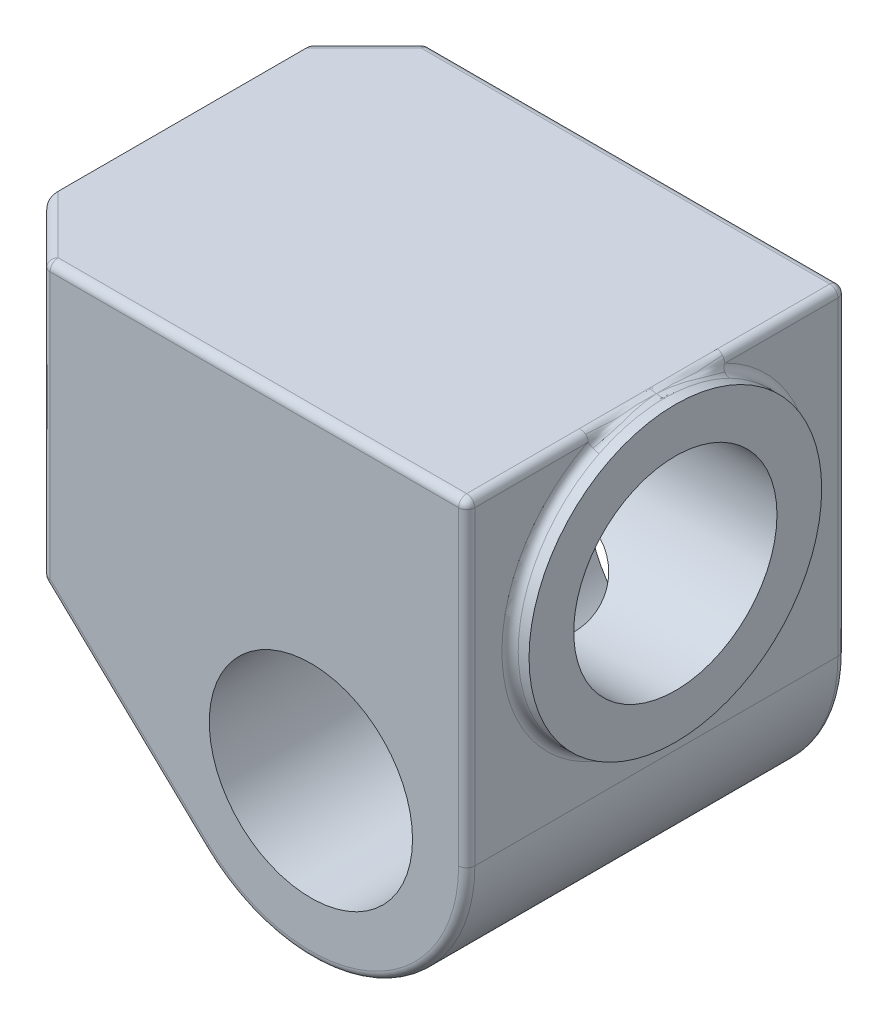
ISO-10303-21;
HEADER;
FILE_DESCRIPTION(('STEP AP214'),'2;1');
FILE_NAME('part.step','',(''),(''),'','','');
FILE_SCHEMA(('AUTOMOTIVE_DESIGN { 1 0 10303 214 1 1 1 1 }'));
ENDSEC;
DATA;
#1=APPLICATION_CONTEXT('core data for automotive mechanical design processes');
#2=APPLICATION_PROTOCOL_DEFINITION('international standard','automotive_design',2000,#1);
#3=PRODUCT_CONTEXT('',#1,'mechanical');
#4=PRODUCT('Part','Part','',(#3));
#5=PRODUCT_RELATED_PRODUCT_CATEGORY('part','',(#4));
#6=PRODUCT_DEFINITION_FORMATION('','',#4);
#7=PRODUCT_DEFINITION_CONTEXT('part definition',#1,'design');
#8=PRODUCT_DEFINITION('design','',#6,#7);
#9=PRODUCT_DEFINITION_SHAPE('','',#8);
#10=(LENGTH_UNIT() NAMED_UNIT(*) SI_UNIT(.MILLI.,.METRE.));
#11=(NAMED_UNIT(*) PLANE_ANGLE_UNIT() SI_UNIT($,.RADIAN.));
#12=(NAMED_UNIT(*) SI_UNIT($,.STERADIAN.) SOLID_ANGLE_UNIT());
#13=UNCERTAINTY_MEASURE_WITH_UNIT(LENGTH_MEASURE(1.E-05),#10,'distance_accuracy_value','');
#14=(GEOMETRIC_REPRESENTATION_CONTEXT(3) GLOBAL_UNCERTAINTY_ASSIGNED_CONTEXT((#13)) GLOBAL_UNIT_ASSIGNED_CONTEXT((#10,
#11,#12)) REPRESENTATION_CONTEXT('',''));
#15=CARTESIAN_POINT('',(0.,0.,0.));
#16=DIRECTION('',(0.,0.,1.));
#17=DIRECTION('',(1.,0.,0.));
#18=AXIS2_PLACEMENT_3D('',#15,#16,#17);
#19=CARTESIAN_POINT('',(-114.5,33.7857142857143,70.));
#20=DIRECTION('',(0.,0.,1.));
#21=DIRECTION('',(1.,0.,0.));
#22=AXIS2_PLACEMENT_3D('',#19,#20,#21);
#23=CYLINDRICAL_SURFACE('',#22,3.);
#24=CARTESIAN_POINT('',(-116.568965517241,31.6133004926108,19.7354603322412));
#25=CARTESIAN_POINT('',(-116.61665064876,31.6587333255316,19.808869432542));
#26=CARTESIAN_POINT('',(-116.662151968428,31.7050448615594,19.8831259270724));
#27=CARTESIAN_POINT('',(-116.7490264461,31.7992588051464,20.0329929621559));
#28=CARTESIAN_POINT('',(-116.790400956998,31.8471606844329,20.1086030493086));
#29=CARTESIAN_POINT('',(-116.869251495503,31.9443685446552,20.260806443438));
#30=CARTESIAN_POINT('',(-116.906731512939,31.9936730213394,20.3373986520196));
#31=CARTESIAN_POINT('',(-116.978023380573,32.0936244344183,20.4914129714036));
#32=CARTESIAN_POINT('',(-117.011834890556,32.1442714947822,20.5688351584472));
#33=CARTESIAN_POINT('',(-117.106860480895,32.2962826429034,20.7993140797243));
#34=CARTESIAN_POINT('',(-117.163044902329,32.3994409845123,20.9532859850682));
#35=CARTESIAN_POINT('',(-117.262479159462,32.6100179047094,21.2625026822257));
#36=CARTESIAN_POINT('',(-117.305726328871,32.7174373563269,21.4177477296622));
#37=CARTESIAN_POINT('',(-117.368290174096,32.902897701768,21.6814406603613));
#38=CARTESIAN_POINT('',(-117.390886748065,32.9799694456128,21.789803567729));
#39=CARTESIAN_POINT('',(-117.429851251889,33.1357774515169,22.0064031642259));
#40=CARTESIAN_POINT('',(-117.446221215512,33.2145131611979,22.114639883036));
#41=CARTESIAN_POINT('',(-117.472804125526,33.3744999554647,22.3320997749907));
#42=CARTESIAN_POINT('',(-117.48293837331,33.4557701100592,22.441318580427));
#43=CARTESIAN_POINT('',(-117.496531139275,33.6197307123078,22.6591736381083));
#44=CARTESIAN_POINT('',(-117.49998685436,33.7024217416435,22.7678096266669));
#45=CARTESIAN_POINT('',(-117.5,33.7857142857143,22.8759966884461));
#46=B_SPLINE_CURVE_WITH_KNOTS('',3,(#24,#25,#26,#27,#28,#29,#30,#31,#32,#33,#34,#35,#36,#37,#38,
#39,#40,#41,#42,#43,#44,#45),.UNSPECIFIED.,.F.,.F.,(4,2,2,2,2,2,2,2,2,2,4),(0.,
0.295813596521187,0.591529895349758,0.886940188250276,1.18237785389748,1.7628114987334,
2.34336468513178,2.74786764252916,3.1522383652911,3.56161309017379,3.97115959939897),.UNSPECIFIED.);
#47=CARTESIAN_POINT('',(-116.568965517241,31.6133004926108,19.7354603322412));
#48=VERTEX_POINT('',#47);
#49=CARTESIAN_POINT('',(-117.5,33.7857142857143,22.8759966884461));
#50=VERTEX_POINT('',#49);
#51=EDGE_CURVE('E11',#48,#50,#46,.T.);
#52=ORIENTED_EDGE('',*,*,#51,.F.);
#53=DIRECTION('',(0.,0.,-1.));
#54=VECTOR('',#53,1.);
#55=CARTESIAN_POINT('',(-116.568965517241,31.6133004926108,-50.));
#56=LINE('',#55,#54);
#57=CARTESIAN_POINT('',(-116.568965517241,31.6133004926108,48.7573593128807));
#58=VERTEX_POINT('',#57);
#59=EDGE_CURVE('E294',#58,#48,#56,.T.);
#60=ORIENTED_EDGE('',*,*,#59,.F.);
#61=CARTESIAN_POINT('',(-114.5,33.7857142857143,48.7573593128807));
#62=DIRECTION('',(0.,0.,1.));
#63=DIRECTION('',(1.,0.,0.));
#64=AXIS2_PLACEMENT_3D('',#61,#62,#63);
#65=CIRCLE('',#64,3.);
#66=CARTESIAN_POINT('',(-117.5,33.7857142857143,48.7573593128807));
#67=VERTEX_POINT('',#66);
#68=EDGE_CURVE('E240',#67,#58,#65,.T.);
#69=ORIENTED_EDGE('',*,*,#68,.F.);
#70=DIRECTION('',(0.,0.,-1.));
#71=VECTOR('',#70,1.);
#72=CARTESIAN_POINT('',(-117.5,33.7857142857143,50.));
#73=LINE('',#72,#71);
#74=EDGE_CURVE('E233',#50,#67,#73,.F.);
#75=ORIENTED_EDGE('',*,*,#74,.F.);
#76=EDGE_LOOP('',(#52,#60,#69,#75));
#77=FACE_BOUND('',#76,.T.);
#78=ADVANCED_FACE('F36',(#77),#23,.T.);
#79=CARTESIAN_POINT('',(57.5,0.,70.));
#80=DIRECTION('',(-1.,0.,0.));
#81=DIRECTION('',(0.,-1.,0.));
#82=AXIS2_PLACEMENT_3D('',#79,#80,#81);
#83=PLANE('',#82);
#84=DIRECTION('',(0.,0.,-1.));
#85=VECTOR('',#84,1.);
#86=CARTESIAN_POINT('',(57.5,114.5,70.));
#87=LINE('',#86,#85);
#88=CARTESIAN_POINT('',(57.5,114.5,25.4558441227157));
#89=VERTEX_POINT('',#88);
#90=CARTESIAN_POINT('',(57.5,114.5,67.));
#91=VERTEX_POINT('',#90);
#92=EDGE_CURVE('E457',#89,#91,#87,.F.);
#93=ORIENTED_EDGE('',*,*,#92,.T.);
#94=DIRECTION('',(0.,1.,0.));
#95=VECTOR('',#94,1.);
#96=CARTESIAN_POINT('',(57.5,0.,67.));
#97=LINE('',#96,#95);
#98=CARTESIAN_POINT('',(57.5,0.,67.));
#99=VERTEX_POINT('',#98);
#100=EDGE_CURVE('E454',#91,#99,#97,.F.);
#101=ORIENTED_EDGE('',*,*,#100,.T.);
#102=DIRECTION('',(0.,0.,-1.));
#103=VECTOR('',#102,1.);
#104=CARTESIAN_POINT('',(57.5,0.,70.));
#105=LINE('',#104,#103);
#106=CARTESIAN_POINT('',(57.5,0.,-67.));
#107=VERTEX_POINT('',#106);
#108=EDGE_CURVE('E378',#99,#107,#105,.T.);
#109=ORIENTED_EDGE('',*,*,#108,.T.);
#110=DIRECTION('',(0.,1.,0.));
#111=VECTOR('',#110,1.);
#112=CARTESIAN_POINT('',(57.5,0.,-67.));
#113=LINE('',#112,#111);
#114=CARTESIAN_POINT('',(57.5,114.5,-67.));
#115=VERTEX_POINT('',#114);
#116=EDGE_CURVE('E448',#107,#115,#113,.T.);
#117=ORIENTED_EDGE('',*,*,#116,.T.);
#118=DIRECTION('',(0.,0.,-1.));
#119=VECTOR('',#118,1.);
#120=CARTESIAN_POINT('',(57.5,114.5,0.));
#121=LINE('',#120,#119);
#122=CARTESIAN_POINT('',(57.5,114.5,-25.4558441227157));
#123=VERTEX_POINT('',#122);
#124=EDGE_CURVE('E453',#115,#123,#121,.F.);
#125=ORIENTED_EDGE('',*,*,#124,.T.);
#126=CARTESIAN_POINT('',(57.5,63.5,0.));
#127=DIRECTION('',(-1.,0.,0.));
#128=DIRECTION('',(0.,-1.,0.));
#129=AXIS2_PLACEMENT_3D('',#126,#127,#128);
#130=CIRCLE('',#129,57.);
#131=EDGE_CURVE('E743',#123,#89,#130,.T.);
#132=ORIENTED_EDGE('',*,*,#131,.T.);
#133=EDGE_LOOP('',(#93,#101,#109,#117,#125,#132));
#134=FACE_BOUND('',#133,.T.);
#135=ADVANCED_FACE('F481',(#134),#83,.F.);
#136=CARTESIAN_POINT('',(-117.5,117.5,70.));
#137=DIRECTION('',(0.,1.,0.));
#138=DIRECTION('',(0.,0.,1.));
#139=AXIS2_PLACEMENT_3D('',#136,#137,#138);
#140=PLANE('',#139);
#141=DIRECTION('',(0.,0.,-1.));
#142=VECTOR('',#141,1.);
#143=CARTESIAN_POINT('',(-117.5,117.5,70.));
#144=LINE('',#143,#142);
#145=CARTESIAN_POINT('',(-117.5,117.5,45.7573593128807));
#146=VERTEX_POINT('',#145);
#147=CARTESIAN_POINT('',(-117.5,117.5,-45.7573593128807));
#148=VERTEX_POINT('',#147);
#149=EDGE_CURVE('E379',#146,#148,#144,.T.);
#150=ORIENTED_EDGE('',*,*,#149,.F.);
#151=DIRECTION('',(0.707106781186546,0.,0.707106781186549));
#152=VECTOR('',#151,1.);
#153=CARTESIAN_POINT('',(-105.37867965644,117.5,57.8786796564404));
#154=LINE('',#153,#152);
#155=CARTESIAN_POINT('',(-96.2573593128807,117.5,67.));
#156=VERTEX_POINT('',#155);
#157=EDGE_CURVE('E269',#146,#156,#154,.T.);
#158=ORIENTED_EDGE('',*,*,#157,.T.);
#159=DIRECTION('',(1.,0.,0.));
#160=VECTOR('',#159,1.);
#161=CARTESIAN_POINT('',(-117.5,117.5,67.));
#162=LINE('',#161,#160);
#163=CARTESIAN_POINT('',(54.5,117.5,67.));
#164=VERTEX_POINT('',#163);
#165=EDGE_CURVE('E242',#156,#164,#162,.T.);
#166=ORIENTED_EDGE('',*,*,#165,.T.);
#167=DIRECTION('',(0.,0.,-1.));
#168=VECTOR('',#167,1.);
#169=CARTESIAN_POINT('',(54.5,117.5,0.));
#170=LINE('',#169,#168);
#171=CARTESIAN_POINT('',(54.5,117.5,25.4558441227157));
#172=VERTEX_POINT('',#171);
#173=EDGE_CURVE('E245',#164,#172,#170,.T.);
#174=ORIENTED_EDGE('',*,*,#173,.T.);
#175=CARTESIAN_POINT('',(54.5,117.5,0.));
#176=CARTESIAN_POINT('',(54.5,117.5,4.24264068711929));
#177=CARTESIAN_POINT('',(54.5,117.5,8.48528137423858));
#178=CARTESIAN_POINT('',(54.5,117.5,16.9705627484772));
#179=CARTESIAN_POINT('',(54.5,117.5,21.2132034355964));
#180=CARTESIAN_POINT('',(54.5,117.5,25.4558441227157));
#181=B_SPLINE_CURVE_WITH_KNOTS('',3,(#175,#176,#177,#178,#179,#180),.UNSPECIFIED.,.F.,.F.,(4,2,
4),(0.,0.5,1.),.UNSPECIFIED.);
#182=CARTESIAN_POINT('',(54.5,117.5,0.));
#183=VERTEX_POINT('',#182);
#184=EDGE_CURVE('E497',#183,#172,#181,.T.);
#185=ORIENTED_EDGE('',*,*,#184,.F.);
#186=CARTESIAN_POINT('',(54.5,117.5,-25.4558441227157));
#187=CARTESIAN_POINT('',(54.5,117.5,-21.2132034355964));
#188=CARTESIAN_POINT('',(54.5,117.5,-16.9705627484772));
#189=CARTESIAN_POINT('',(54.5,117.5,-8.48528137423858));
#190=CARTESIAN_POINT('',(54.5,117.5,-4.24264068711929));
#191=CARTESIAN_POINT('',(54.5,117.5,0.));
#192=B_SPLINE_CURVE_WITH_KNOTS('',3,(#186,#187,#188,#189,#190,#191),.UNSPECIFIED.,.F.,.F.,(4,2,
4),(0.,0.5,1.),.UNSPECIFIED.);
#193=CARTESIAN_POINT('',(54.5,117.5,-25.4558441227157));
#194=VERTEX_POINT('',#193);
#195=EDGE_CURVE('E461',#194,#183,#192,.T.);
#196=ORIENTED_EDGE('',*,*,#195,.F.);
#197=DIRECTION('',(0.,0.,-1.));
#198=VECTOR('',#197,1.);
#199=CARTESIAN_POINT('',(54.5,117.5,-70.));
#200=LINE('',#199,#198);
#201=CARTESIAN_POINT('',(54.5,117.5,-67.));
#202=VERTEX_POINT('',#201);
#203=EDGE_CURVE('E456',#194,#202,#200,.T.);
#204=ORIENTED_EDGE('',*,*,#203,.T.);
#205=DIRECTION('',(1.,0.,0.));
#206=VECTOR('',#205,1.);
#207=CARTESIAN_POINT('',(-97.4999999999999,117.5,-67.));
#208=LINE('',#207,#206);
#209=CARTESIAN_POINT('',(-96.2573593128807,117.5,-67.));
#210=VERTEX_POINT('',#209);
#211=EDGE_CURVE('E458',#202,#210,#208,.F.);
#212=ORIENTED_EDGE('',*,*,#211,.T.);
#213=DIRECTION('',(0.707106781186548,0.,-0.707106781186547));
#214=VECTOR('',#213,1.);
#215=CARTESIAN_POINT('',(-175.37867965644,117.5,12.1213203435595));
#216=LINE('',#215,#214);
#217=EDGE_CURVE('E267',#210,#148,#216,.F.);
#218=ORIENTED_EDGE('',*,*,#217,.T.);
#219=EDGE_LOOP('',(#150,#158,#166,#174,#185,#196,#204,#212,#218));
#220=FACE_BOUND('',#219,.T.);
#221=ADVANCED_FACE('F471',(#220),#140,.T.);
#222=CARTESIAN_POINT('',(-117.5,117.5,70.));
#223=DIRECTION('',(1.,0.,0.));
#224=DIRECTION('',(0.,1.,0.));
#225=AXIS2_PLACEMENT_3D('',#222,#223,#224);
#226=PLANE('',#225);
#227=CARTESIAN_POINT('',(-117.5,33.7857142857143,-48.7573593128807));
#228=VERTEX_POINT('',#227);
#229=CARTESIAN_POINT('',(-117.5,33.7857142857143,-22.8759966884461));
#230=VERTEX_POINT('',#229);
#231=EDGE_CURVE('E236',#228,#230,#73,.F.);
#232=ORIENTED_EDGE('',*,*,#231,.T.);
#233=CARTESIAN_POINT('',(-117.5,63.5,0.));
#234=DIRECTION('',(1.,0.,0.));
#235=DIRECTION('',(0.,0.,-1.));
#236=AXIS2_PLACEMENT_3D('',#233,#234,#235);
#237=CIRCLE('',#236,37.5);
#238=EDGE_CURVE('E56',#230,#50,#237,.T.);
#239=ORIENTED_EDGE('',*,*,#238,.T.);
#240=ORIENTED_EDGE('',*,*,#74,.T.);
#241=DIRECTION('',(0.,1.,0.));
#242=VECTOR('',#241,1.);
#243=CARTESIAN_POINT('',(-117.5,117.5,48.7573593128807));
#244=LINE('',#243,#242);
#245=CARTESIAN_POINT('',(-117.5,116.62132034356,48.7573593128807));
#246=VERTEX_POINT('',#245);
#247=EDGE_CURVE('E254',#67,#246,#244,.T.);
#248=ORIENTED_EDGE('',*,*,#247,.T.);
#249=CARTESIAN_POINT('',(-117.5,114.5,45.7573593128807));
#250=DIRECTION('',(1.,0.,0.));
#251=DIRECTION('',(0.,0.,1.));
#252=AXIS2_PLACEMENT_3D('',#249,#250,#251);
#253=ELLIPSE('',#252,4.24264068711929,3.);
#254=EDGE_CURVE('E256',#246,#146,#253,.F.);
#255=ORIENTED_EDGE('',*,*,#254,.T.);
#256=ORIENTED_EDGE('',*,*,#149,.T.);
#257=CARTESIAN_POINT('',(-117.5,114.5,-45.7573593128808));
#258=DIRECTION('',(1.,0.,0.));
#259=DIRECTION('',(0.,0.,-1.));
#260=AXIS2_PLACEMENT_3D('',#257,#258,#259);
#261=ELLIPSE('',#260,4.24264068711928,3.);
#262=CARTESIAN_POINT('',(-117.5,116.62132034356,-48.7573593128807));
#263=VERTEX_POINT('',#262);
#264=EDGE_CURVE('E252',#148,#263,#261,.F.);
#265=ORIENTED_EDGE('',*,*,#264,.T.);
#266=DIRECTION('',(0.,1.,0.));
#267=VECTOR('',#266,1.);
#268=CARTESIAN_POINT('',(-117.5,32.5,-48.7573593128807));
#269=LINE('',#268,#267);
#270=EDGE_CURVE('E244',#263,#228,#269,.F.);
#271=ORIENTED_EDGE('',*,*,#270,.T.);
#272=EDGE_LOOP('',(#232,#239,#240,#248,#255,#256,#265,#271));
#273=FACE_BOUND('',#272,.T.);
#274=ADVANCED_FACE('F231',(#273),#226,.F.);
#275=CARTESIAN_POINT('',(-39.6551724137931,-41.6379310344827,70.));
#276=DIRECTION('',(-0.689655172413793,-0.724137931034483,0.));
#277=DIRECTION('',(0.724137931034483,-0.689655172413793,0.));
#278=AXIS2_PLACEMENT_3D('',#275,#276,#277);
#279=PLANE('',#278);
#280=CARTESIAN_POINT('',(-150.05,63.5,0.));
#281=DIRECTION('',(-0.689655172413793,-0.724137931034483,0.));
#282=DIRECTION('',(0.724137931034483,-0.689655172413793,0.));
#283=AXIS2_PLACEMENT_3D('',#280,#281,#282);
#284=ELLIPSE('',#283,54.375,37.5);
#285=CARTESIAN_POINT('',(-116.568965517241,31.6133004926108,-19.7354603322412));
#286=VERTEX_POINT('',#285);
#287=EDGE_CURVE('E224',#286,#48,#284,.T.);
#288=ORIENTED_EDGE('',*,*,#287,.F.);
#289=CARTESIAN_POINT('',(-116.568965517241,31.6133004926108,-48.7573593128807));
#290=VERTEX_POINT('',#289);
#291=EDGE_CURVE('E64',#286,#290,#56,.T.);
#292=ORIENTED_EDGE('',*,*,#291,.T.);
#293=DIRECTION('',(-0.586509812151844,0.558580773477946,0.586509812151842));
#294=VECTOR('',#293,1.);
#295=CARTESIAN_POINT('',(-106.964827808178,22.4665026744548,-58.3614970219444));
#296=LINE('',#295,#294);
#297=CARTESIAN_POINT('',(-98.326324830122,14.2393569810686,-67.));
#298=VERTEX_POINT('',#297);
#299=EDGE_CURVE('E296',#290,#298,#296,.F.);
#300=ORIENTED_EDGE('',*,*,#299,.T.);
#301=DIRECTION('',(-0.724137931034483,0.689655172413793,0.));
#302=VECTOR('',#301,1.);
#303=CARTESIAN_POINT('',(-39.6551724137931,-41.6379310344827,-67.));
#304=LINE('',#303,#302);
#305=CARTESIAN_POINT('',(-39.6551724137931,-41.6379310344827,-67.));
#306=VERTEX_POINT('',#305);
#307=EDGE_CURVE('E382',#298,#306,#304,.F.);
#308=ORIENTED_EDGE('',*,*,#307,.T.);
#309=DIRECTION('',(0.,0.,-1.));
#310=VECTOR('',#309,1.);
#311=CARTESIAN_POINT('',(-39.6551724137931,-41.6379310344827,70.));
#312=LINE('',#311,#310);
#313=CARTESIAN_POINT('',(-39.6551724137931,-41.6379310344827,67.));
#314=VERTEX_POINT('',#313);
#315=EDGE_CURVE('E383',#314,#306,#312,.T.);
#316=ORIENTED_EDGE('',*,*,#315,.F.);
#317=DIRECTION('',(-0.724137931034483,0.689655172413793,0.));
#318=VECTOR('',#317,1.);
#319=CARTESIAN_POINT('',(-39.6551724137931,-41.6379310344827,67.));
#320=LINE('',#319,#318);
#321=CARTESIAN_POINT('',(-98.3263248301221,14.2393569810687,67.));
#322=VERTEX_POINT('',#321);
#323=EDGE_CURVE('E389',#314,#322,#320,.T.);
#324=ORIENTED_EDGE('',*,*,#323,.T.);
#325=DIRECTION('',(-0.586509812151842,0.558580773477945,-0.586509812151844));
#326=VECTOR('',#325,1.);
#327=CARTESIAN_POINT('',(-58.8057014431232,-23.3993319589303,106.520623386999));
#328=LINE('',#327,#326);
#329=EDGE_CURVE('E292',#322,#58,#328,.T.);
#330=ORIENTED_EDGE('',*,*,#329,.T.);
#331=ORIENTED_EDGE('',*,*,#59,.T.);
#332=EDGE_LOOP('',(#288,#292,#300,#308,#316,#324,#330,#331));
#333=FACE_BOUND('',#332,.T.);
#334=ADVANCED_FACE('F859',(#333),#279,.T.);
#335=CARTESIAN_POINT('',(0.,0.,70.));
#336=DIRECTION('',(0.,0.,-1.));
#337=DIRECTION('',(-1.,0.,0.));
#338=AXIS2_PLACEMENT_3D('',#335,#336,#337);
#339=CYLINDRICAL_SURFACE('',#338,57.5);
#340=ORIENTED_EDGE('',*,*,#108,.F.);
#341=CARTESIAN_POINT('',(0.,0.,67.));
#342=DIRECTION('',(0.,0.,1.));
#343=DIRECTION('',(1.,0.,0.));
#344=AXIS2_PLACEMENT_3D('',#341,#342,#343);
#345=CIRCLE('',#344,57.5);
#346=EDGE_CURVE('E412',#99,#314,#345,.F.);
#347=ORIENTED_EDGE('',*,*,#346,.T.);
#348=ORIENTED_EDGE('',*,*,#315,.T.);
#349=CARTESIAN_POINT('',(0.,0.,-67.));
#350=DIRECTION('',(0.,0.,1.));
#351=DIRECTION('',(1.,0.,0.));
#352=AXIS2_PLACEMENT_3D('',#349,#350,#351);
#353=CIRCLE('',#352,57.5);
#354=EDGE_CURVE('E410',#306,#107,#353,.T.);
#355=ORIENTED_EDGE('',*,*,#354,.T.);
#356=EDGE_LOOP('',(#340,#347,#348,#355));
#357=FACE_BOUND('',#356,.T.);
#358=ADVANCED_FACE('F976',(#357),#339,.T.);
#359=CARTESIAN_POINT('',(0.,0.,70.));
#360=DIRECTION('',(0.,0.,1.));
#361=DIRECTION('',(1.,0.,0.));
#362=AXIS2_PLACEMENT_3D('',#359,#360,#361);
#363=PLANE('',#362);
#364=CARTESIAN_POINT('',(0.,0.,70.));
#365=DIRECTION('',(0.,0.,1.));
#366=DIRECTION('',(1.,0.,0.));
#367=AXIS2_PLACEMENT_3D('',#364,#365,#366);
#368=CIRCLE('',#367,37.5);
#369=CARTESIAN_POINT('',(37.5,0.,70.));
#370=VERTEX_POINT('',#369);
#371=EDGE_CURVE('E372',#370,#370,#368,.T.);
#372=ORIENTED_EDGE('',*,*,#371,.F.);
#373=EDGE_LOOP('',(#372));
#374=FACE_BOUND('',#373,.T.);
#375=DIRECTION('',(1.,0.,0.));
#376=VECTOR('',#375,1.);
#377=CARTESIAN_POINT('',(0.,114.5,70.));
#378=LINE('',#377,#376);
#379=CARTESIAN_POINT('',(54.5,114.5,70.));
#380=VERTEX_POINT('',#379);
#381=CARTESIAN_POINT('',(-96.2573593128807,114.5,70.));
#382=VERTEX_POINT('',#381);
#383=EDGE_CURVE('E392',#380,#382,#378,.F.);
#384=ORIENTED_EDGE('',*,*,#383,.T.);
#385=DIRECTION('',(0.,-1.,0.));
#386=VECTOR('',#385,1.);
#387=CARTESIAN_POINT('',(-96.2573593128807,0.,70.));
#388=LINE('',#387,#386);
#389=CARTESIAN_POINT('',(-96.2573593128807,16.4117707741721,70.));
#390=VERTEX_POINT('',#389);
#391=EDGE_CURVE('E273',#382,#390,#388,.T.);
#392=ORIENTED_EDGE('',*,*,#391,.T.);
#393=DIRECTION('',(-0.724137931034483,0.689655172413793,0.));
#394=VECTOR('',#393,1.);
#395=CARTESIAN_POINT('',(-37.5862068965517,-39.4655172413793,70.));
#396=LINE('',#395,#394);
#397=CARTESIAN_POINT('',(-37.5862068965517,-39.4655172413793,70.));
#398=VERTEX_POINT('',#397);
#399=EDGE_CURVE('E399',#390,#398,#396,.F.);
#400=ORIENTED_EDGE('',*,*,#399,.T.);
#401=CARTESIAN_POINT('',(0.,0.,70.));
#402=DIRECTION('',(0.,0.,1.));
#403=DIRECTION('',(1.,0.,0.));
#404=AXIS2_PLACEMENT_3D('',#401,#402,#403);
#405=CIRCLE('',#404,54.5);
#406=CARTESIAN_POINT('',(54.5,0.,70.));
#407=VERTEX_POINT('',#406);
#408=EDGE_CURVE('E397',#398,#407,#405,.T.);
#409=ORIENTED_EDGE('',*,*,#408,.T.);
#410=DIRECTION('',(0.,1.,0.));
#411=VECTOR('',#410,1.);
#412=CARTESIAN_POINT('',(54.5,117.5,70.));
#413=LINE('',#412,#411);
#414=EDGE_CURVE('E395',#407,#380,#413,.T.);
#415=ORIENTED_EDGE('',*,*,#414,.T.);
#416=EDGE_LOOP('',(#384,#392,#400,#409,#415));
#417=FACE_BOUND('',#416,.T.);
#418=ADVANCED_FACE('F435',(#374,#417),#363,.T.);
#419=CARTESIAN_POINT('',(0.,0.,-70.));
#420=DIRECTION('',(0.,0.,1.));
#421=DIRECTION('',(1.,0.,0.));
#422=AXIS2_PLACEMENT_3D('',#419,#420,#421);
#423=PLANE('',#422);
#424=CARTESIAN_POINT('',(0.,0.,-70.));
#425=DIRECTION('',(0.,0.,1.));
#426=DIRECTION('',(1.,0.,0.));
#427=AXIS2_PLACEMENT_3D('',#424,#425,#426);
#428=CIRCLE('',#427,37.5);
#429=CARTESIAN_POINT('',(37.5,0.,-70.));
#430=VERTEX_POINT('',#429);
#431=EDGE_CURVE('E368',#430,#430,#428,.T.);
#432=ORIENTED_EDGE('',*,*,#431,.T.);
#433=EDGE_LOOP('',(#432));
#434=FACE_BOUND('',#433,.T.);
#435=DIRECTION('',(-0.724137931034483,0.689655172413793,0.));
#436=VECTOR('',#435,1.);
#437=CARTESIAN_POINT('',(-95.4310344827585,15.6247947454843,-70.));
#438=LINE('',#437,#436);
#439=CARTESIAN_POINT('',(-37.5862068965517,-39.4655172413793,-70.));
#440=VERTEX_POINT('',#439);
#441=CARTESIAN_POINT('',(-96.2573593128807,16.4117707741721,-70.));
#442=VERTEX_POINT('',#441);
#443=EDGE_CURVE('E407',#440,#442,#438,.T.);
#444=ORIENTED_EDGE('',*,*,#443,.T.);
#445=DIRECTION('',(0.,-1.,0.));
#446=VECTOR('',#445,1.);
#447=CARTESIAN_POINT('',(-96.2573593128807,114.5,-70.));
#448=LINE('',#447,#446);
#449=CARTESIAN_POINT('',(-96.2573593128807,114.5,-70.));
#450=VERTEX_POINT('',#449);
#451=EDGE_CURVE('E290',#442,#450,#448,.F.);
#452=ORIENTED_EDGE('',*,*,#451,.T.);
#453=DIRECTION('',(1.,0.,0.));
#454=VECTOR('',#453,1.);
#455=CARTESIAN_POINT('',(57.5,114.5,-70.));
#456=LINE('',#455,#454);
#457=CARTESIAN_POINT('',(54.5,114.5,-70.));
#458=VERTEX_POINT('',#457);
#459=EDGE_CURVE('E403',#450,#458,#456,.T.);
#460=ORIENTED_EDGE('',*,*,#459,.T.);
#461=DIRECTION('',(0.,1.,0.));
#462=VECTOR('',#461,1.);
#463=CARTESIAN_POINT('',(54.5,0.,-70.));
#464=LINE('',#463,#462);
#465=CARTESIAN_POINT('',(54.5,0.,-70.));
#466=VERTEX_POINT('',#465);
#467=EDGE_CURVE('E401',#458,#466,#464,.F.);
#468=ORIENTED_EDGE('',*,*,#467,.T.);
#469=CARTESIAN_POINT('',(0.,0.,-70.));
#470=DIRECTION('',(0.,0.,1.));
#471=DIRECTION('',(1.,0.,0.));
#472=AXIS2_PLACEMENT_3D('',#469,#470,#471);
#473=CIRCLE('',#472,54.5);
#474=EDGE_CURVE('E405',#466,#440,#473,.F.);
#475=ORIENTED_EDGE('',*,*,#474,.T.);
#476=EDGE_LOOP('',(#444,#452,#460,#468,#475));
#477=FACE_BOUND('',#476,.T.);
#478=ADVANCED_FACE('F434',(#434,#477),#423,.F.);
#479=CARTESIAN_POINT('',(64.5,63.5,0.));
#480=DIRECTION('',(-1.,0.,0.));
#481=DIRECTION('',(0.,0.,1.));
#482=AXIS2_PLACEMENT_3D('',#479,#480,#481);
#483=CYLINDRICAL_SURFACE('',#482,54.);
#484=CARTESIAN_POINT('',(60.5,111.815789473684,24.1160628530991));
#485=CARTESIAN_POINT('',(60.5,112.781032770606,22.1822276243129));
#486=CARTESIAN_POINT('',(60.5,113.617173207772,20.2168637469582));
#487=CARTESIAN_POINT('',(60.5,115.041947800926,16.24439124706));
#488=CARTESIAN_POINT('',(60.5,115.630613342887,14.2372301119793));
#489=CARTESIAN_POINT('',(60.5,116.568887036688,10.1976858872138));
#490=CARTESIAN_POINT('',(60.5,116.918514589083,8.16525051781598));
#491=CARTESIAN_POINT('',(60.5,117.38406645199,4.0885693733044));
#492=CARTESIAN_POINT('',(60.5,117.5,2.04427178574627));
#493=CARTESIAN_POINT('',(60.5,117.5,0.));
#494=B_SPLINE_CURVE_WITH_KNOTS('',3,(#484,#485,#486,#487,#488,#489,#490,#491,#492,#493),
.UNSPECIFIED.,.F.,.F.,(4,2,2,2,4),(0.,0.25,0.5,0.75,1.),.UNSPECIFIED.);
#495=CARTESIAN_POINT('',(60.5,111.815789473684,24.1160628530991));
#496=VERTEX_POINT('',#495);
#497=CARTESIAN_POINT('',(60.5,117.5,0.));
#498=VERTEX_POINT('',#497);
#499=EDGE_CURVE('E449',#496,#498,#494,.T.);
#500=ORIENTED_EDGE('',*,*,#499,.F.);
#501=CARTESIAN_POINT('',(60.5,63.5,0.));
#502=DIRECTION('',(-1.,0.,0.));
#503=DIRECTION('',(0.,-1.,0.));
#504=AXIS2_PLACEMENT_3D('',#501,#502,#503);
#505=CIRCLE('',#504,54.);
#506=CARTESIAN_POINT('',(60.5,111.815789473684,-24.1160628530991));
#507=VERTEX_POINT('',#506);
#508=EDGE_CURVE('E441',#496,#507,#505,.F.);
#509=ORIENTED_EDGE('',*,*,#508,.T.);
#510=CARTESIAN_POINT('',(60.5,117.5,0.));
#511=CARTESIAN_POINT('',(60.5,117.5,-2.04427178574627));
#512=CARTESIAN_POINT('',(60.5,117.38406645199,-4.0885693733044));
#513=CARTESIAN_POINT('',(60.5,116.918514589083,-8.16525051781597));
#514=CARTESIAN_POINT('',(60.5,116.568887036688,-10.1976858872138));
#515=CARTESIAN_POINT('',(60.5,115.630613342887,-14.2372301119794));
#516=CARTESIAN_POINT('',(60.5,115.041947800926,-16.24439124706));
#517=CARTESIAN_POINT('',(60.5,113.617173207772,-20.2168637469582));
#518=CARTESIAN_POINT('',(60.5,112.781032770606,-22.1822276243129));
#519=CARTESIAN_POINT('',(60.5,111.815789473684,-24.1160628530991));
#520=B_SPLINE_CURVE_WITH_KNOTS('',3,(#510,#511,#512,#513,#514,#515,#516,#517,#518,#519),
.UNSPECIFIED.,.F.,.F.,(4,2,2,2,4),(0.,0.25,0.5,0.75,1.),.UNSPECIFIED.);
#521=EDGE_CURVE('E414',#498,#507,#520,.T.);
#522=ORIENTED_EDGE('',*,*,#521,.F.);
#523=EDGE_LOOP('',(#500,#509,#522));
#524=FACE_BOUND('',#523,.T.);
#525=CARTESIAN_POINT('',(64.5,63.5,0.));
#526=DIRECTION('',(1.,0.,0.));
#527=DIRECTION('',(0.,0.,-1.));
#528=AXIS2_PLACEMENT_3D('',#525,#526,#527);
#529=CIRCLE('',#528,54.);
#530=CARTESIAN_POINT('',(64.5,63.5,-54.));
#531=VERTEX_POINT('',#530);
#532=EDGE_CURVE('E371',#531,#531,#529,.T.);
#533=ORIENTED_EDGE('',*,*,#532,.F.);
#534=EDGE_LOOP('',(#533));
#535=FACE_BOUND('',#534,.T.);
#536=ADVANCED_FACE('F424',(#524,#535),#483,.T.);
#537=CARTESIAN_POINT('',(64.5,63.5,0.));
#538=DIRECTION('',(1.,0.,0.));
#539=DIRECTION('',(0.,0.,-1.));
#540=AXIS2_PLACEMENT_3D('',#537,#538,#539);
#541=PLANE('',#540);
#542=CARTESIAN_POINT('',(64.4999999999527,63.5,0.));
#543=DIRECTION('',(1.,0.,0.));
#544=DIRECTION('',(0.,0.,-1.));
#545=AXIS2_PLACEMENT_3D('',#542,#543,#544);
#546=CIRCLE('',#545,37.5);
#547=CARTESIAN_POINT('',(64.4999999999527,63.5,-37.5));
#548=VERTEX_POINT('',#547);
#549=EDGE_CURVE('E237',#548,#548,#546,.T.);
#550=ORIENTED_EDGE('',*,*,#549,.F.);
#551=EDGE_LOOP('',(#550));
#552=FACE_BOUND('',#551,.T.);
#553=ORIENTED_EDGE('',*,*,#532,.T.);
#554=EDGE_LOOP('',(#553));
#555=FACE_BOUND('',#554,.T.);
#556=ADVANCED_FACE('F433',(#552,#555),#541,.T.);
#557=CARTESIAN_POINT('',(0.,0.,-70.));
#558=DIRECTION('',(0.,0.,1.));
#559=DIRECTION('',(1.,0.,0.));
#560=AXIS2_PLACEMENT_3D('',#557,#558,#559);
#561=CYLINDRICAL_SURFACE('',#560,37.5);
#562=CARTESIAN_POINT('',(0.,37.5,-27.0231382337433));
#563=CARTESIAN_POINT('',(-0.731884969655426,37.4999987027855,-27.0231385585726));
#564=CARTESIAN_POINT('',(-1.46379053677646,37.4785440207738,-27.0025441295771));
#565=CARTESIAN_POINT('',(-2.92278545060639,37.3930657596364,-26.9199088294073));
#566=CARTESIAN_POINT('',(-3.64987460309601,37.3290404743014,-26.8578662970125));
#567=CARTESIAN_POINT('',(-5.09443427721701,37.1594624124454,-26.6915750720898));
#568=CARTESIAN_POINT('',(-5.81190351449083,37.0539041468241,-26.5873208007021));
#569=CARTESIAN_POINT('',(-7.23214503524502,36.8030711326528,-26.335442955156));
#570=CARTESIAN_POINT('',(-7.93491751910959,36.6577969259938,-26.1878199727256));
#571=CARTESIAN_POINT('',(-9.32208934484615,36.32984391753,-25.8474090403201));
#572=CARTESIAN_POINT('',(-10.0064497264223,36.1470919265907,-25.654532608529));
#573=CARTESIAN_POINT('',(-11.3502118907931,35.7479218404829,-25.2221859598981));
#574=CARTESIAN_POINT('',(-12.009613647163,35.531503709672,-24.9827156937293));
#575=CARTESIAN_POINT('',(-13.2981006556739,35.0696265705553,-24.4558066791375));
#576=CARTESIAN_POINT('',(-13.9271975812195,34.8241788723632,-24.168386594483));
#577=CARTESIAN_POINT('',(-15.1504187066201,34.3096929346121,-23.5444126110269));
#578=CARTESIAN_POINT('',(-15.7445440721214,34.0406554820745,-23.2078603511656));
#579=CARTESIAN_POINT('',(-16.8797042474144,33.4919932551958,-22.4937179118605));
#580=CARTESIAN_POINT('',(-17.4216630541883,33.2127700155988,-22.1172881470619));
#581=CARTESIAN_POINT('',(-18.4643180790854,32.6446240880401,-21.3175106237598));
#582=CARTESIAN_POINT('',(-18.9650149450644,32.3557015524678,-20.8941636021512));
#583=CARTESIAN_POINT('',(-19.9221976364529,31.7752948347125,-20.0019044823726));
#584=CARTESIAN_POINT('',(-20.3786910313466,31.4838111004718,-19.5330002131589));
#585=CARTESIAN_POINT('',(-21.245596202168,30.9054404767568,-18.551789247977));
#586=CARTESIAN_POINT('',(-21.6560090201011,30.6185534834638,-18.0394835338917));
#587=CARTESIAN_POINT('',(-22.4133827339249,30.0682581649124,-16.997093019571));
#588=CARTESIAN_POINT('',(-22.7622921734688,29.8043699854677,-16.4686745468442));
#589=CARTESIAN_POINT('',(-23.4167963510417,29.2929377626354,-15.3782151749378));
#590=CARTESIAN_POINT('',(-23.7223924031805,29.0453932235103,-14.8161752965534));
#591=CARTESIAN_POINT('',(-24.2908286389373,28.571710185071,-13.6621262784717));
#592=CARTESIAN_POINT('',(-24.5536608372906,28.3455756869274,-13.0701115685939));
#593=CARTESIAN_POINT('',(-25.0374635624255,27.9191591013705,-11.8602365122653));
#594=CARTESIAN_POINT('',(-25.2584326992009,27.7188778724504,-11.2423753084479));
#595=CARTESIAN_POINT('',(-25.6650169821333,27.3429267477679,-9.96838478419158));
#596=CARTESIAN_POINT('',(-25.8495450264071,27.1680459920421,-9.31167584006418));
#597=CARTESIAN_POINT('',(-26.1771713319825,26.8525129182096,-7.97997469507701));
#598=CARTESIAN_POINT('',(-26.3202690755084,26.7118610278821,-7.3049822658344));
#599=CARTESIAN_POINT('',(-26.5663671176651,26.467117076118,-5.94102567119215));
#600=CARTESIAN_POINT('',(-26.6693568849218,26.3630346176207,-5.25205788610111));
#601=CARTESIAN_POINT('',(-26.8362430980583,26.193133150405,-3.86473116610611));
#602=CARTESIAN_POINT('',(-26.9001381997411,26.1273154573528,-3.16637190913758));
#603=CARTESIAN_POINT('',(-26.9920759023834,26.0323363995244,-1.72483124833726));
#604=CARTESIAN_POINT('',(-27.017879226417,26.0054660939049,-0.981354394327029));
#605=CARTESIAN_POINT('',(-27.0269487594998,25.9960393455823,0.506155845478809));
#606=CARTESIAN_POINT('',(-27.0102133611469,26.0134845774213,1.25018925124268));
#607=CARTESIAN_POINT('',(-26.9339787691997,26.0924089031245,2.7338801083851));
#608=CARTESIAN_POINT('',(-26.8744707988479,26.1538970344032,3.47353663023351));
#609=CARTESIAN_POINT('',(-26.7119387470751,26.3198746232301,4.94319011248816));
#610=CARTESIAN_POINT('',(-26.6089146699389,26.4243640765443,5.67318707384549));
#611=CARTESIAN_POINT('',(-26.3558511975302,26.6767996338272,7.1315844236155));
#612=CARTESIAN_POINT('',(-26.2049842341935,26.8255075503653,7.85971001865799));
#613=CARTESIAN_POINT('',(-25.8552704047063,27.1627308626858,9.29495902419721));
#614=CARTESIAN_POINT('',(-25.656422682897,27.3512469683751,10.0020820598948));
#615=CARTESIAN_POINT('',(-25.2090843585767,27.7640884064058,11.38938801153));
#616=CARTESIAN_POINT('',(-24.9606124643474,27.9884002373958,12.0695809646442));
#617=CARTESIAN_POINT('',(-24.4123651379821,28.4678578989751,13.3976623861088));
#618=CARTESIAN_POINT('',(-24.1125924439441,28.7230020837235,14.0455525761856));
#619=CARTESIAN_POINT('',(-23.4735652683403,29.2473169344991,15.2785650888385));
#620=CARTESIAN_POINT('',(-23.1363604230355,29.5155233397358,15.8651598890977));
#621=CARTESIAN_POINT('',(-22.4131656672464,30.0683727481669,16.9992423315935));
#622=CARTESIAN_POINT('',(-22.0271771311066,30.3530152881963,17.5467310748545));
#623=CARTESIAN_POINT('',(-21.2070098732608,30.9316081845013,18.5986598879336));
#624=CARTESIAN_POINT('',(-20.7728488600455,31.2255550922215,19.1031156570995));
#625=CARTESIAN_POINT('',(-19.8576510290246,31.815403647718,20.0662734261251));
#626=CARTESIAN_POINT('',(-19.3766158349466,32.1113052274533,20.5249770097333));
#627=CARTESIAN_POINT('',(-18.3965827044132,32.6821080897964,21.3718166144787));
#628=CARTESIAN_POINT('',(-17.8998575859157,32.9572957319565,21.7623944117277));
#629=CARTESIAN_POINT('',(-16.8693562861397,33.4964608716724,22.4999192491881));
#630=CARTESIAN_POINT('',(-16.3355815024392,33.7604387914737,22.8468679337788));
#631=CARTESIAN_POINT('',(-15.2343087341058,34.2714804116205,23.4971224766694));
#632=CARTESIAN_POINT('',(-14.6668055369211,34.5185414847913,23.8004215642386));
#633=CARTESIAN_POINT('',(-13.5019908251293,34.9905867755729,24.3638771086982));
#634=CARTESIAN_POINT('',(-12.904678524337,35.2155704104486,24.6240324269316));
#635=CARTESIAN_POINT('',(-11.6781512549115,35.6412184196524,25.1046298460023));
#636=CARTESIAN_POINT('',(-11.0486731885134,35.8416115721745,25.3246401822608));
#637=CARTESIAN_POINT('',(-9.76788198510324,36.2116397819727,25.7229338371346));
#638=CARTESIAN_POINT('',(-9.11656881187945,36.3812747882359,25.9012170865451));
#639=CARTESIAN_POINT('',(-7.79632607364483,36.686871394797,26.2174469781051));
#640=CARTESIAN_POINT('',(-7.12739225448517,36.8228247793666,26.3553837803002));
#641=CARTESIAN_POINT('',(-5.77638561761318,37.0587867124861,26.5921072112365));
#642=CARTESIAN_POINT('',(-5.09431230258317,37.1587938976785,26.690892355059));
#643=CARTESIAN_POINT('',(-3.68218896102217,37.3259331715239,26.8548466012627));
#644=CARTESIAN_POINT('',(-2.9516182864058,37.3908694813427,26.9177817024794));
#645=CARTESIAN_POINT('',(-1.48552242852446,37.4777606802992,27.0017906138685));
#646=CARTESIAN_POINT('',(-0.749997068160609,37.4997140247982,27.0228629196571));
#647=CARTESIAN_POINT('',(0.721282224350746,37.500280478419,27.0234082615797));
#648=CARTESIAN_POINT('',(1.45703616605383,37.478882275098,27.0028704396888));
#649=CARTESIAN_POINT('',(2.92366631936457,37.3930713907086,26.9199149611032));
#650=CARTESIAN_POINT('',(3.65454248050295,37.3286582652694,26.8574968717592));
#651=CARTESIAN_POINT('',(5.12882591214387,37.1552523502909,26.6874409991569));
#652=CARTESIAN_POINT('',(5.871926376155,37.0449483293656,26.5784703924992));
#653=CARTESIAN_POINT('',(7.34216316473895,36.7817936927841,26.3139169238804));
#654=CARTESIAN_POINT('',(8.06929907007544,36.6289419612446,26.1583328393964));
#655=CARTESIAN_POINT('',(9.50179914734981,36.2837215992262,25.7989576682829));
#656=CARTESIAN_POINT('',(10.2071683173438,36.091362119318,25.5951777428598));
#657=CARTESIAN_POINT('',(11.5906045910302,35.671142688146,25.1376432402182));
#658=CARTESIAN_POINT('',(12.2686728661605,35.4432842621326,24.8838908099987));
#659=CARTESIAN_POINT('',(13.5733834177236,34.9640201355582,24.3326401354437));
#660=CARTESIAN_POINT('',(14.2009336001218,34.7134512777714,24.0365639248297));
#661=CARTESIAN_POINT('',(15.4199962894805,34.1893825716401,23.3946418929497));
#662=CARTESIAN_POINT('',(16.0115094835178,33.915883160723,23.0487970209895));
#663=CARTESIAN_POINT('',(17.1537161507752,33.3527410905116,22.3071590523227));
#664=CARTESIAN_POINT('',(17.7044289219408,33.0631061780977,21.9113898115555));
#665=CARTESIAN_POINT('',(18.7614993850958,32.4749443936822,21.070336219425));
#666=CARTESIAN_POINT('',(19.2678592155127,32.1764179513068,20.625054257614));
#667=CARTESIAN_POINT('',(20.2056900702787,31.5953621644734,19.7134289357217));
#668=CARTESIAN_POINT('',(20.6397872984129,31.3128937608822,19.2497441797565));
#669=CARTESIAN_POINT('',(21.4643439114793,30.7535394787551,18.2820011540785));
#670=CARTESIAN_POINT('',(21.8548050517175,30.4766533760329,17.7779445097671));
#671=CARTESIAN_POINT('',(22.5913461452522,29.9347664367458,16.7323581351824));
#672=CARTESIAN_POINT('',(22.9374224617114,29.6697665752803,16.1908253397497));
#673=CARTESIAN_POINT('',(23.5851564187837,29.1575200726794,15.0738696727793));
#674=CARTESIAN_POINT('',(23.886813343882,28.9102737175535,14.4984462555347));
#675=CARTESIAN_POINT('',(24.4443389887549,28.4403995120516,13.3218934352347));
#676=CARTESIAN_POINT('',(24.7005169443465,28.2176096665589,12.7209750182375));
#677=CARTESIAN_POINT('',(25.1707251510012,27.7989879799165,11.4938260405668));
#678=CARTESIAN_POINT('',(25.3847558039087,27.6031558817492,10.8675957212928));
#679=CARTESIAN_POINT('',(25.771986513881,27.241968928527,9.59392881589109));
#680=CARTESIAN_POINT('',(25.9451771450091,27.076621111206,8.9464873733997));
#681=CARTESIAN_POINT('',(26.2519819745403,26.7792660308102,7.63478984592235));
#682=CARTESIAN_POINT('',(26.3855946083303,26.6472600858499,6.9705330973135));
#683=CARTESIAN_POINT('',(26.6204888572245,26.4126607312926,5.59393978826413));
#684=CARTESIAN_POINT('',(26.7196863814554,26.3119925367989,4.88091860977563));
#685=CARTESIAN_POINT('',(26.8766257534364,26.1516646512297,3.4457614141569));
#686=CARTESIAN_POINT('',(26.9343662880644,26.0920062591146,2.72362510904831));
#687=CARTESIAN_POINT('',(27.0090866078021,26.0146525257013,1.27480479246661));
#688=CARTESIAN_POINT('',(27.0260548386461,25.9969690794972,0.548119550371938));
#689=CARTESIAN_POINT('',(27.0194052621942,26.0038793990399,-0.904870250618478));
#690=CARTESIAN_POINT('',(26.995786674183,26.0284739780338,-1.63117480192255));
#691=CARTESIAN_POINT('',(26.9058398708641,26.1214509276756,-3.10877872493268));
#692=CARTESIAN_POINT('',(26.8377772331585,26.1916108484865,-3.85986220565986));
#693=CARTESIAN_POINT('',(26.6564336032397,26.3761492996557,-5.3510916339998));
#694=CARTESIAN_POINT('',(26.5431511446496,26.4905292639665,-6.09123722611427));
#695=CARTESIAN_POINT('',(26.2700410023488,26.7613884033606,-7.55502058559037));
#696=CARTESIAN_POINT('',(26.1102168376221,26.9178643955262,-8.27865959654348));
#697=CARTESIAN_POINT('',(25.7423761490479,27.2698519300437,-9.70386931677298));
#698=CARTESIAN_POINT('',(25.5343610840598,27.4653622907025,-10.4054406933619));
#699=CARTESIAN_POINT('',(25.0718188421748,27.8881793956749,-11.7707880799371));
#700=CARTESIAN_POINT('',(24.8180188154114,28.1149775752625,-12.4349675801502));
#701=CARTESIAN_POINT('',(24.2604465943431,28.5974922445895,-13.7311001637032));
#702=CARTESIAN_POINT('',(23.956674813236,28.8532084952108,-14.3630535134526));
#703=CARTESIAN_POINT('',(23.2983049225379,29.3873863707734,-15.5893120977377));
#704=CARTESIAN_POINT('',(22.943733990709,29.6658357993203,-16.183637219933));
#705=CARTESIAN_POINT('',(22.1833661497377,30.2386284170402,-17.330375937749));
#706=CARTESIAN_POINT('',(21.7775721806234,30.5329706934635,-17.8827919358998));
#707=CARTESIAN_POINT('',(20.9400394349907,31.1128447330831,-18.9116605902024));
#708=CARTESIAN_POINT('',(20.5110967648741,31.3979227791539,-19.3906481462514));
#709=CARTESIAN_POINT('',(19.6097607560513,31.9686045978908,-20.3054620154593));
#710=CARTESIAN_POINT('',(19.1373691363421,32.2542083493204,-20.7412900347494));
#711=CARTESIAN_POINT('',(18.1514740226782,32.8191516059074,-21.5681799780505));
#712=CARTESIAN_POINT('',(17.6379707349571,33.0984911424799,-21.959242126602));
#713=CARTESIAN_POINT('',(16.5729624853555,33.6443889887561,-22.6958752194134));
#714=CARTESIAN_POINT('',(16.0214574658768,33.9109472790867,-23.041446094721));
#715=CARTESIAN_POINT('',(14.8977182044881,34.41916902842,-23.6794789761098));
#716=CARTESIAN_POINT('',(14.3262880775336,34.6612735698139,-23.9730079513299));
#717=CARTESIAN_POINT('',(13.1546594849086,35.1226609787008,-24.5174225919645));
#718=CARTESIAN_POINT('',(12.5544614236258,35.3419441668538,-24.7683088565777));
#719=CARTESIAN_POINT('',(11.3293115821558,35.7535225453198,-25.2285226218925));
#720=CARTESIAN_POINT('',(10.7043564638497,35.9458140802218,-25.4378444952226));
#721=CARTESIAN_POINT('',(9.43395643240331,36.2999356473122,-25.8161512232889));
#722=CARTESIAN_POINT('',(8.78851121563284,36.4617652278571,-25.9851354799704));
#723=CARTESIAN_POINT('',(7.47881227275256,36.7528111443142,-26.2846283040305));
#724=CARTESIAN_POINT('',(6.81449555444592,36.881899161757,-26.4149858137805));
#725=CARTESIAN_POINT('',(5.473653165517,37.104595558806,-26.6375189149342));
#726=CARTESIAN_POINT('',(4.79712756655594,37.1982041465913,-26.729694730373));
#727=CARTESIAN_POINT('',(3.43586229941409,37.3485454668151,-26.8768023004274));
#728=CARTESIAN_POINT('',(2.75112119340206,37.4052716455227,-26.9317274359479));
#729=CARTESIAN_POINT('',(1.37759291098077,37.481000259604,-27.0048959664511));
#730=CARTESIAN_POINT('',(0.688805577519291,37.5000012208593,-27.0231379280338));
#731=CARTESIAN_POINT('',(0.,37.5,-27.0231382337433));
#732=B_SPLINE_CURVE_WITH_KNOTS('',3,(#562,#563,#564,#565,#566,#567,#568,#569,#570,#571,#572,
#573,#574,#575,#576,#577,#578,#579,#580,#581,#582,#583,#584,#585,#586,#587,#588,#589,#590,#591,
#592,#593,#594,#595,#596,#597,#598,#599,#600,#601,#602,#603,#604,#605,#606,#607,#608,#609,#610,
#611,#612,#613,#614,#615,#616,#617,#618,#619,#620,#621,#622,#623,#624,#625,#626,#627,#628,#629,
#630,#631,#632,#633,#634,#635,#636,#637,#638,#639,#640,#641,#642,#643,#644,#645,#646,#647,#648,
#649,#650,#651,#652,#653,#654,#655,#656,#657,#658,#659,#660,#661,#662,#663,#664,#665,#666,#667,
#668,#669,#670,#671,#672,#673,#674,#675,#676,#677,#678,#679,#680,#681,#682,#683,#684,#685,#686,
#687,#688,#689,#690,#691,#692,#693,#694,#695,#696,#697,#698,#699,#700,#701,#702,#703,#704,#705,
#706,#707,#708,#709,#710,#711,#712,#713,#714,#715,#716,#717,#718,#719,#720,#721,#722,#723,#724,
#725,#726,#727,#728,#729,#730,#731),.UNSPECIFIED.,.T.,.F.,(4,2,2,2,2,2,2,2,2,2,2,2,2,2,2,2,2,2,
2,2,2,2,2,2,2,2,2,2,2,2,2,2,2,2,2,2,2,2,2,2,2,2,2,2,2,2,2,2,2,2,2,2,2,2,2,2,2,2,2,2,2,2,2,2,2,2,
2,2,2,2,2,2,2,2,2,2,2,2,2,2,2,2,2,2,4),(0.,2.19508586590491,4.39025971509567,6.58572378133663,
8.78115789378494,10.980920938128,13.1806863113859,15.3795974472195,17.5784352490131,
19.7252077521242,21.8719465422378,24.0183170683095,26.1646390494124,28.2202556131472,
30.2758097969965,32.3317473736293,34.3877532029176,36.4980266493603,38.6083264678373,
40.7191800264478,42.8301061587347,45.0607719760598,47.2915220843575,49.5227300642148,
51.7539378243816,54.0260638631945,56.2982304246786,58.5695419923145,60.84073237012,
63.0214071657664,65.2020205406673,67.3818349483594,69.561573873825,71.6267517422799,
73.6918517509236,75.7572717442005,77.822746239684,79.9092712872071,81.9957997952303,
84.0828367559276,86.1699528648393,88.3758919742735,90.5819103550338,92.7885044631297,
94.9951213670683,97.2696630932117,99.5442644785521,101.818339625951,104.092317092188,
106.302693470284,108.513027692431,110.7223096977,112.931485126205,115.014387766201,
117.097206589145,119.180195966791,121.263218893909,123.331485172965,125.399731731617,
127.468455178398,129.537260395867,131.71549993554,133.893808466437,136.072734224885,
138.251701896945,140.521238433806,142.790848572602,145.060287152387,147.32965703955,
149.565733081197,151.801790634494,154.036656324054,156.271393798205,158.378787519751,
160.48609790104,162.593397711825,164.700700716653,166.757923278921,168.815116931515,
170.872588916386,172.930091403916,174.995537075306,177.060970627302,179.126771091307,
181.192652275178),.UNSPECIFIED.);
#733=CARTESIAN_POINT('',(0.,37.5,-27.0231382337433));
#734=VERTEX_POINT('',#733);
#735=EDGE_CURVE('E301',#734,#734,#732,.T.);
#736=ORIENTED_EDGE('',*,*,#735,.T.);
#737=EDGE_LOOP('',(#736));
#738=FACE_BOUND('',#737,.T.);
#739=ORIENTED_EDGE('',*,*,#431,.F.);
#740=EDGE_LOOP('',(#739));
#741=FACE_BOUND('',#740,.T.);
#742=ORIENTED_EDGE('',*,*,#371,.T.);
#743=EDGE_LOOP('',(#742));
#744=FACE_BOUND('',#743,.T.);
#745=ADVANCED_FACE('F355',(#738,#741,#744),#561,.F.);
#746=CARTESIAN_POINT('',(-97.5,0.,70.));
#747=DIRECTION('',(-0.707106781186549,0.,0.707106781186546));
#748=DIRECTION('',(0.707106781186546,0.,0.707106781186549));
#749=AXIS2_PLACEMENT_3D('',#746,#747,#748);
#750=PLANE('',#749);
#751=DIRECTION('',(0.707106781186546,0.,0.707106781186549));
#752=VECTOR('',#751,1.);
#753=CARTESIAN_POINT('',(-97.5,114.5,70.));
#754=LINE('',#753,#752);
#755=CARTESIAN_POINT('',(-98.3786796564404,114.5,69.1213203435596));
#756=VERTEX_POINT('',#755);
#757=CARTESIAN_POINT('',(-116.62132034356,114.5,50.8786796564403));
#758=VERTEX_POINT('',#757);
#759=EDGE_CURVE('E262',#756,#758,#754,.F.);
#760=ORIENTED_EDGE('',*,*,#759,.T.);
#761=DIRECTION('',(0.,1.,0.));
#762=VECTOR('',#761,1.);
#763=CARTESIAN_POINT('',(-116.62132034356,32.5,50.8786796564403));
#764=LINE('',#763,#762);
#765=CARTESIAN_POINT('',(-116.62132034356,33.7857142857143,50.8786796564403));
#766=VERTEX_POINT('',#765);
#767=EDGE_CURVE('E264',#758,#766,#764,.F.);
#768=ORIENTED_EDGE('',*,*,#767,.T.);
#769=DIRECTION('',(-0.586509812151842,0.558580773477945,-0.586509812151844));
#770=VECTOR('',#769,1.);
#771=CARTESIAN_POINT('',(-92.3974478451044,10.7153595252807,75.1025521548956));
#772=LINE('',#771,#770);
#773=CARTESIAN_POINT('',(-98.3786796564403,16.4117707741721,69.1213203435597));
#774=VERTEX_POINT('',#773);
#775=EDGE_CURVE('E258',#766,#774,#772,.F.);
#776=ORIENTED_EDGE('',*,*,#775,.T.);
#777=DIRECTION('',(0.,-1.,0.));
#778=VECTOR('',#777,1.);
#779=CARTESIAN_POINT('',(-98.3786796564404,0.,69.1213203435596));
#780=LINE('',#779,#778);
#781=EDGE_CURVE('E260',#774,#756,#780,.F.);
#782=ORIENTED_EDGE('',*,*,#781,.T.);
#783=EDGE_LOOP('',(#760,#768,#776,#782));
#784=FACE_BOUND('',#783,.T.);
#785=ADVANCED_FACE('F483',(#784),#750,.T.);
#786=CARTESIAN_POINT('',(-117.5,117.5,-50.));
#787=DIRECTION('',(0.707106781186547,0.,0.707106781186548));
#788=DIRECTION('',(0.707106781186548,0.,-0.707106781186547));
#789=AXIS2_PLACEMENT_3D('',#786,#787,#788);
#790=PLANE('',#789);
#791=DIRECTION('',(0.,-1.,0.));
#792=VECTOR('',#791,1.);
#793=CARTESIAN_POINT('',(-116.62132034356,117.5,-50.8786796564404));
#794=LINE('',#793,#792);
#795=CARTESIAN_POINT('',(-116.62132034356,33.7857142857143,-50.8786796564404));
#796=VERTEX_POINT('',#795);
#797=CARTESIAN_POINT('',(-116.62132034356,114.5,-50.8786796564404));
#798=VERTEX_POINT('',#797);
#799=EDGE_CURVE('E283',#796,#798,#794,.F.);
#800=ORIENTED_EDGE('',*,*,#799,.T.);
#801=DIRECTION('',(-0.707106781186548,0.,0.707106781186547));
#802=VECTOR('',#801,1.);
#803=CARTESIAN_POINT('',(-117.5,114.5,-50.));
#804=LINE('',#803,#802);
#805=CARTESIAN_POINT('',(-98.3786796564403,114.5,-69.1213203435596));
#806=VERTEX_POINT('',#805);
#807=EDGE_CURVE('E285',#798,#806,#804,.F.);
#808=ORIENTED_EDGE('',*,*,#807,.T.);
#809=DIRECTION('',(0.,1.,0.));
#810=VECTOR('',#809,1.);
#811=CARTESIAN_POINT('',(-98.3786796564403,17.595238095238,-69.1213203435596));
#812=LINE('',#811,#810);
#813=CARTESIAN_POINT('',(-98.3786796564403,16.4117707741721,-69.1213203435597));
#814=VERTEX_POINT('',#813);
#815=EDGE_CURVE('E281',#806,#814,#812,.F.);
#816=ORIENTED_EDGE('',*,*,#815,.T.);
#817=DIRECTION('',(0.586509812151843,-0.558580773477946,-0.586509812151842));
#818=VECTOR('',#817,1.);
#819=CARTESIAN_POINT('',(-144.651738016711,60.4813501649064,-22.8482619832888));
#820=LINE('',#819,#818);
#821=EDGE_CURVE('E279',#814,#796,#820,.F.);
#822=ORIENTED_EDGE('',*,*,#821,.T.);
#823=EDGE_LOOP('',(#800,#808,#816,#822));
#824=FACE_BOUND('',#823,.T.);
#825=ADVANCED_FACE('F921',(#824),#790,.F.);
#826=CARTESIAN_POINT('',(57.5321049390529,117.479701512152,0.));
#827=CARTESIAN_POINT('',(58.0272328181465,117.480398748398,0.));
#828=CARTESIAN_POINT('',(58.5805337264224,117.391714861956,0.));
#829=CARTESIAN_POINT('',(59.8034816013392,117.035584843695,0.));
#830=CARTESIAN_POINT('',(59.9948089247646,117.5,0.));
#831=CARTESIAN_POINT('',(60.5,117.5,0.));
#832=CARTESIAN_POINT('',(57.6558869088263,117.479875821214,2.09630896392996));
#833=CARTESIAN_POINT('',(58.0781889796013,117.465559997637,1.61151641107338));
#834=CARTESIAN_POINT('',(58.5805337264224,117.391714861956,1.50165560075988));
#835=CARTESIAN_POINT('',(59.8034816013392,117.035584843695,1.62118177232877));
#836=CARTESIAN_POINT('',(59.9948089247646,117.5,1.85056875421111));
#837=CARTESIAN_POINT('',(60.5,117.5,2.04427178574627));
#838=CARTESIAN_POINT('',(57.8163550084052,117.379769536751,4.17352305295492));
#839=CARTESIAN_POINT('',(58.1838574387,117.405744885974,3.36287320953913));
#840=CARTESIAN_POINT('',(58.6452540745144,117.356257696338,3.20284431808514));
#841=CARTESIAN_POINT('',(59.8203762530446,117.001710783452,3.42436717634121));
#842=CARTESIAN_POINT('',(60.0128997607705,117.404547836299,3.8057017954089));
#843=CARTESIAN_POINT('',(60.5,117.38406645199,4.0885693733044));
#844=CARTESIAN_POINT('',(58.2106634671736,116.97899578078,8.2897614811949));
#845=CARTESIAN_POINT('',(58.5130822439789,117.083748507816,7.1460511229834));
#846=CARTESIAN_POINT('',(58.8934871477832,117.067257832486,6.95834170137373));
#847=CARTESIAN_POINT('',(59.8904700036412,116.722068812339,7.30264433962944));
#848=CARTESIAN_POINT('',(60.065494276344,116.968186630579,7.83380813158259));
#849=CARTESIAN_POINT('',(60.5,116.918514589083,8.16525051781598));
#850=CARTESIAN_POINT('',(58.4445038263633,116.67832830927,10.3287858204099));
#851=CARTESIAN_POINT('',(58.7366385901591,116.82156724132,9.1778722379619));
#852=CARTESIAN_POINT('',(59.07699987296,116.813655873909,9.0123001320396));
#853=CARTESIAN_POINT('',(59.9436691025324,116.476180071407,9.37704858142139));
#854=CARTESIAN_POINT('',(60.0999979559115,116.627154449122,9.90610686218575));
#855=CARTESIAN_POINT('',(60.5,116.568887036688,10.1976858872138));
#856=CARTESIAN_POINT('',(58.9855568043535,115.876432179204,14.36864474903));
#857=CARTESIAN_POINT('',(59.310102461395,115.982425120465,13.5227623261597));
#858=CARTESIAN_POINT('',(59.5521693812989,115.959990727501,13.4198209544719));
#859=CARTESIAN_POINT('',(60.0888868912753,115.665074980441,13.6901613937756));
#860=CARTESIAN_POINT('',(60.1656493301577,115.680913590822,14.0613934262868));
#861=CARTESIAN_POINT('',(60.5,115.630613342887,14.2372301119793));
#862=CARTESIAN_POINT('',(59.0270201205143,115.328160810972,16.3817599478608));
#863=CARTESIAN_POINT('',(59.3717168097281,115.391833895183,15.6797844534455));
#864=CARTESIAN_POINT('',(59.6219703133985,115.358137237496,15.6139195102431));
#865=CARTESIAN_POINT('',(60.1031963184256,115.104958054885,15.8470957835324));
#866=CARTESIAN_POINT('',(60.1967970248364,115.07585399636,16.1437137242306));
#867=CARTESIAN_POINT('',(60.5,115.041947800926,16.24439124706));
#868=CARTESIAN_POINT('',(58.8536470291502,114.077772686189,20.3820812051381));
#869=CARTESIAN_POINT('',(59.2183141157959,113.997279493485,19.9705806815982));
#870=CARTESIAN_POINT('',(59.5300400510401,113.900637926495,19.9435061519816));
#871=CARTESIAN_POINT('',(60.0498449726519,113.690226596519,20.0684815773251));
#872=CARTESIAN_POINT('',(60.2359676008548,113.619098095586,20.2176391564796));
#873=CARTESIAN_POINT('',(60.5,113.617173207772,20.2168637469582));
#874=CARTESIAN_POINT('',(58.6388106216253,113.375655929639,22.3692872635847));
#875=CARTESIAN_POINT('',(59.0032970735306,113.193316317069,22.1043547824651));
#876=CARTESIAN_POINT('',(59.3683088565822,113.045219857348,22.0786868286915));
#877=CARTESIAN_POINT('',(59.9821841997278,112.836059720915,22.1323312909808));
#878=CARTESIAN_POINT('',(60.2439904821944,112.767841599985,22.208655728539));
#879=CARTESIAN_POINT('',(60.5,112.781032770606,22.1822276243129));
#880=CARTESIAN_POINT('',(58.396737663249,112.667017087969,24.3373984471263));
#881=CARTESIAN_POINT('',(58.7367662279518,112.347001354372,24.2303037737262));
#882=CARTESIAN_POINT('',(59.1428293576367,112.118278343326,24.1713827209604));
#883=CARTESIAN_POINT('',(59.8908526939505,111.856158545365,24.1156752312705));
#884=CARTESIAN_POINT('',(60.2305665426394,111.815789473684,24.1160628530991));
#885=CARTESIAN_POINT('',(60.5,111.815789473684,24.1160628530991));
#886=B_SPLINE_SURFACE_WITH_KNOTS('',3,3,((#826,#827,#828,#829,#830,#831),(#832,#833,#834,#835,
#836,#837),(#838,#839,#840,#841,#842,#843),(#844,#845,#846,#847,#848,#849),(#850,#851,#852,#853,
#854,#855),(#856,#857,#858,#859,#860,#861),(#862,#863,#864,#865,#866,#867),(#868,#869,#870,#871,
#872,#873),(#874,#875,#876,#877,#878,#879),(#880,#881,#882,#883,#884,#885)),.UNSPECIFIED.,.F.,
.F.,.F.,(4,2,2,2,4),(4,2,4),(0.,0.25,0.5,0.75,1.),(0.,0.5,1.),.UNSPECIFIED.);
#887=CARTESIAN_POINT('',(57.5321049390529,117.479701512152,0.));
#888=CARTESIAN_POINT('',(57.6558869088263,117.479875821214,2.09630896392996));
#889=CARTESIAN_POINT('',(57.8163550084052,117.379769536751,4.17352305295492));
#890=CARTESIAN_POINT('',(58.2106634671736,116.97899578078,8.2897614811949));
#891=CARTESIAN_POINT('',(58.4445038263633,116.67832830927,10.3287858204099));
#892=CARTESIAN_POINT('',(58.9855568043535,115.876432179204,14.36864474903));
#893=CARTESIAN_POINT('',(59.0270201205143,115.328160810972,16.3817599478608));
#894=CARTESIAN_POINT('',(58.8536470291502,114.077772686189,20.3820812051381));
#895=CARTESIAN_POINT('',(58.6388106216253,113.375655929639,22.3692872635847));
#896=CARTESIAN_POINT('',(58.396737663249,112.667017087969,24.3373984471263));
#897=B_SPLINE_CURVE_WITH_KNOTS('',3,(#887,#888,#889,#890,#891,#892,#893,#894,#895,#896),
.UNSPECIFIED.,.F.,.F.,(4,2,2,2,4),(0.,0.25,0.5,0.75,1.),.UNSPECIFIED.);
#898=CARTESIAN_POINT('',(58.396737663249,112.667017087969,24.3373984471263));
#899=VERTEX_POINT('',#898);
#900=CARTESIAN_POINT('',(57.5321049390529,117.479701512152,0.));
#901=VERTEX_POINT('',#900);
#902=EDGE_CURVE('E375',#899,#901,#897,.F.);
#903=CARTESIAN_POINT('',(58.396737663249,112.667017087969,24.3373984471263));
#904=CARTESIAN_POINT('',(58.7367662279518,112.347001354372,24.2303037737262));
#905=CARTESIAN_POINT('',(59.1428293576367,112.118278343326,24.1713827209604));
#906=CARTESIAN_POINT('',(59.8908526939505,111.856158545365,24.1156752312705));
#907=CARTESIAN_POINT('',(60.2305665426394,111.815789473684,24.1160628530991));
#908=CARTESIAN_POINT('',(60.5,111.815789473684,24.1160628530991));
#909=B_SPLINE_CURVE_WITH_KNOTS('',3,(#903,#904,#905,#906,#907,#908),.UNSPECIFIED.,.F.,.F.,(4,2,
4),(0.,0.5,1.),.UNSPECIFIED.);
#910=EDGE_CURVE('E728',#899,#496,#909,.T.);
#911=CARTESIAN_POINT('',(57.5321049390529,117.479701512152,0.));
#912=CARTESIAN_POINT('',(58.0272328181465,117.480398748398,0.));
#913=CARTESIAN_POINT('',(58.5805337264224,117.391714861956,0.));
#914=CARTESIAN_POINT('',(59.8034816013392,117.035584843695,0.));
#915=CARTESIAN_POINT('',(59.9948089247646,117.5,0.));
#916=CARTESIAN_POINT('',(60.5,117.5,0.));
#917=B_SPLINE_CURVE_WITH_KNOTS('',3,(#911,#912,#913,#914,#915,#916),.UNSPECIFIED.,.F.,.F.,(4,2,
4),(0.,0.5,1.),.UNSPECIFIED.);
#918=EDGE_CURVE('E720',#498,#901,#917,.F.);
#919=ORIENTED_EDGE('',*,*,#902,.F.);
#920=ORIENTED_EDGE('',*,*,#910,.T.);
#921=ORIENTED_EDGE('',*,*,#499,.T.);
#922=ORIENTED_EDGE('',*,*,#918,.T.);
#923=EDGE_LOOP('',(#919,#920,#921,#922));
#924=FACE_BOUND('',#923,.T.);
#925=ADVANCED_FACE('F647',(#924),#886,.T.);
#926=CARTESIAN_POINT('',(57.5321049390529,117.479701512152,0.));
#927=CARTESIAN_POINT('',(57.6558869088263,117.479875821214,-2.09630896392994));
#928=CARTESIAN_POINT('',(57.8163550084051,117.379769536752,-4.1735230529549));
#929=CARTESIAN_POINT('',(58.2106634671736,116.97899578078,-8.28976148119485));
#930=CARTESIAN_POINT('',(58.4445038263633,116.67832830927,-10.3287858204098));
#931=CARTESIAN_POINT('',(58.9855568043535,115.876432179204,-14.3686447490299));
#932=CARTESIAN_POINT('',(59.0270201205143,115.328160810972,-16.3817599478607));
#933=CARTESIAN_POINT('',(58.8536470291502,114.077772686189,-20.3820812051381));
#934=CARTESIAN_POINT('',(58.6388106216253,113.375655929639,-22.3692872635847));
#935=CARTESIAN_POINT('',(58.396737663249,112.667017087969,-24.3373984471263));
#936=CARTESIAN_POINT('',(58.0272328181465,117.480398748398,0.));
#937=CARTESIAN_POINT('',(58.0781889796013,117.465559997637,-1.61151641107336));
#938=CARTESIAN_POINT('',(58.1838574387,117.405744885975,-3.36287320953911));
#939=CARTESIAN_POINT('',(58.5130822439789,117.083748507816,-7.14605112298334));
#940=CARTESIAN_POINT('',(58.7366385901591,116.82156724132,-9.17787223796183));
#941=CARTESIAN_POINT('',(59.3101024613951,115.982425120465,-13.5227623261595));
#942=CARTESIAN_POINT('',(59.3717168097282,115.391833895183,-15.6797844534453));
#943=CARTESIAN_POINT('',(59.218314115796,113.997279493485,-19.9705806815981));
#944=CARTESIAN_POINT('',(59.0032970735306,113.193316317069,-22.1043547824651));
#945=CARTESIAN_POINT('',(58.7367662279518,112.347001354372,-24.2303037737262));
#946=CARTESIAN_POINT('',(58.5805337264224,117.391714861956,0.));
#947=CARTESIAN_POINT('',(58.5805337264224,117.391714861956,-1.50165560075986));
#948=CARTESIAN_POINT('',(58.6452540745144,117.356257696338,-3.20284431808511));
#949=CARTESIAN_POINT('',(58.8934871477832,117.067257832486,-6.95834170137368));
#950=CARTESIAN_POINT('',(59.07699987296,116.813655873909,-9.01230013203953));
#951=CARTESIAN_POINT('',(59.552169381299,115.959990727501,-13.4198209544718));
#952=CARTESIAN_POINT('',(59.6219703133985,115.358137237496,-15.613919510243));
#953=CARTESIAN_POINT('',(59.5300400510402,113.900637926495,-19.9435061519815));
#954=CARTESIAN_POINT('',(59.3683088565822,113.045219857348,-22.0786868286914));
#955=CARTESIAN_POINT('',(59.1428293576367,112.118278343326,-24.1713827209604));
#956=CARTESIAN_POINT('',(59.8034816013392,117.035584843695,0.));
#957=CARTESIAN_POINT('',(59.8034816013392,117.035584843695,-1.62118177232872));
#958=CARTESIAN_POINT('',(59.8203762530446,117.001710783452,-3.42436717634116));
#959=CARTESIAN_POINT('',(59.8904700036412,116.722068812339,-7.30264433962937));
#960=CARTESIAN_POINT('',(59.9436691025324,116.476180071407,-9.37704858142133));
#961=CARTESIAN_POINT('',(60.0888868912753,115.665074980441,-13.6901613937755));
#962=CARTESIAN_POINT('',(60.1031963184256,115.104958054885,-15.8470957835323));
#963=CARTESIAN_POINT('',(60.0498449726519,113.690226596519,-20.0684815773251));
#964=CARTESIAN_POINT('',(59.9821841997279,112.836059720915,-22.1323312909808));
#965=CARTESIAN_POINT('',(59.8908526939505,111.856158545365,-24.1156752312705));
#966=CARTESIAN_POINT('',(59.9948089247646,117.5,0.));
#967=CARTESIAN_POINT('',(59.9948089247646,117.5,-1.85056875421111));
#968=CARTESIAN_POINT('',(60.0128997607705,117.404547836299,-3.80570179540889));
#969=CARTESIAN_POINT('',(60.065494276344,116.968186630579,-7.83380813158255));
#970=CARTESIAN_POINT('',(60.0999979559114,116.627154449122,-9.90610686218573));
#971=CARTESIAN_POINT('',(60.1656493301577,115.680913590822,-14.0613934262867));
#972=CARTESIAN_POINT('',(60.1967970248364,115.07585399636,-16.1437137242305));
#973=CARTESIAN_POINT('',(60.2359676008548,113.619098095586,-20.2176391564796));
#974=CARTESIAN_POINT('',(60.2439904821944,112.767841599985,-22.2086557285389));
#975=CARTESIAN_POINT('',(60.2305665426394,111.815789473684,-24.1160628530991));
#976=CARTESIAN_POINT('',(60.5,117.5,0.));
#977=CARTESIAN_POINT('',(60.5,117.5,-2.04427178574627));
#978=CARTESIAN_POINT('',(60.5,117.38406645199,-4.0885693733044));
#979=CARTESIAN_POINT('',(60.5,116.918514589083,-8.16525051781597));
#980=CARTESIAN_POINT('',(60.5,116.568887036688,-10.1976858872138));
#981=CARTESIAN_POINT('',(60.5,115.630613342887,-14.2372301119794));
#982=CARTESIAN_POINT('',(60.5,115.041947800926,-16.24439124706));
#983=CARTESIAN_POINT('',(60.5,113.617173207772,-20.2168637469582));
#984=CARTESIAN_POINT('',(60.5,112.781032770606,-22.1822276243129));
#985=CARTESIAN_POINT('',(60.5,111.815789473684,-24.1160628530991));
#986=B_SPLINE_SURFACE_WITH_KNOTS('',3,3,((#926,#927,#928,#929,#930,#931,#932,#933,#934,#935),
(#936,#937,#938,#939,#940,#941,#942,#943,#944,#945),(#946,#947,#948,#949,#950,#951,#952,#953,
#954,#955),(#956,#957,#958,#959,#960,#961,#962,#963,#964,#965),(#966,#967,#968,#969,#970,#971,
#972,#973,#974,#975),(#976,#977,#978,#979,#980,#981,#982,#983,#984,#985)),.UNSPECIFIED.,.F.,.F.,
.F.,(4,2,4),(4,2,2,2,4),(0.,0.5,1.),(0.,0.25,0.5,0.75,1.),.UNSPECIFIED.);
#987=CARTESIAN_POINT('',(60.5,111.815789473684,-24.1160628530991));
#988=CARTESIAN_POINT('',(60.2305665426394,111.815789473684,-24.1160628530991));
#989=CARTESIAN_POINT('',(59.8908526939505,111.856158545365,-24.1156752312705));
#990=CARTESIAN_POINT('',(59.1428293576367,112.118278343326,-24.1713827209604));
#991=CARTESIAN_POINT('',(58.7367662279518,112.347001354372,-24.2303037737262));
#992=CARTESIAN_POINT('',(58.396737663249,112.667017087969,-24.3373984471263));
#993=B_SPLINE_CURVE_WITH_KNOTS('',3,(#987,#988,#989,#990,#991,#992),.UNSPECIFIED.,.F.,.F.,(4,2,
4),(0.,0.5,1.),.UNSPECIFIED.);
#994=CARTESIAN_POINT('',(58.396737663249,112.667017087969,-24.3373984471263));
#995=VERTEX_POINT('',#994);
#996=EDGE_CURVE('E737',#507,#995,#993,.T.);
#997=CARTESIAN_POINT('',(57.5321049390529,117.479701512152,0.));
#998=CARTESIAN_POINT('',(57.7796688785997,117.480050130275,-4.19261792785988));
#999=CARTESIAN_POINT('',(58.1739773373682,117.079276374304,-8.30885635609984));
#1000=CARTESIAN_POINT('',(59.2560832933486,115.475484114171,-16.3885742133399));
#1001=CARTESIAN_POINT('',(58.8808835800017,114.084294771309,-20.401176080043));
#1002=CARTESIAN_POINT('',(58.396737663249,112.667017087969,-24.3373984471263));
#1003=B_SPLINE_CURVE_WITH_KNOTS('',3,(#997,#998,#999,#1000,#1001,#1002),.UNSPECIFIED.,.F.,.F.,
(4,2,4),(0.,0.5,1.),.UNSPECIFIED.);
#1004=EDGE_CURVE('E778',#995,#901,#1003,.F.);
#1005=ORIENTED_EDGE('',*,*,#918,.F.);
#1006=ORIENTED_EDGE('',*,*,#521,.T.);
#1007=ORIENTED_EDGE('',*,*,#996,.T.);
#1008=ORIENTED_EDGE('',*,*,#1004,.T.);
#1009=EDGE_LOOP('',(#1005,#1006,#1007,#1008));
#1010=FACE_BOUND('',#1009,.T.);
#1011=ADVANCED_FACE('F796',(#1010),#986,.T.);
#1012=CARTESIAN_POINT('',(57.5321049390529,117.479701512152,0.));
#1013=CARTESIAN_POINT('',(57.2845409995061,117.479352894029,-4.19261792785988));
#1014=CARTESIAN_POINT('',(57.1194475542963,117.172337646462,-8.4029919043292));
#1015=CARTESIAN_POINT('',(56.9542016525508,115.944973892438,-16.8592519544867));
#1016=CARTESIAN_POINT('',(56.6091626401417,116.633430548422,-21.0541299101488));
#1017=CARTESIAN_POINT('',(56.6022848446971,116.640186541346,-25.2667639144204));
#1018=CARTESIAN_POINT('',(57.7796688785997,117.480050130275,-4.19261792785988));
#1019=CARTESIAN_POINT('',(57.6105436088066,117.242080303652,-6.50882267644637));
#1020=CARTESIAN_POINT('',(57.4458879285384,116.958044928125,-9.70852236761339));
#1021=CARTESIAN_POINT('',(57.2752966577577,115.635476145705,-17.5651684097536));
#1022=CARTESIAN_POINT('',(56.9382450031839,116.308028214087,-21.4664183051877));
#1023=CARTESIAN_POINT('',(56.9424345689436,116.306060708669,-25.2189755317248));
#1024=CARTESIAN_POINT('',(58.1739773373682,117.079276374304,-8.30885635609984));
#1025=CARTESIAN_POINT('',(57.8980480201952,116.91741444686,-9.61228551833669));
#1026=CARTESIAN_POINT('',(57.6323129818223,116.61833556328,-12.243117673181));
#1027=CARTESIAN_POINT('',(57.4118382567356,115.448323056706,-19.0064676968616));
#1028=CARTESIAN_POINT('',(57.2124030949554,115.858578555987,-22.3822500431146));
#1029=CARTESIAN_POINT('',(57.2147695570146,115.853357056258,-25.1716461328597));
#1030=CARTESIAN_POINT('',(59.2560832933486,115.475484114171,-16.3885742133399));
#1031=CARTESIAN_POINT('',(58.9153321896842,115.388114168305,-17.0819410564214));
#1032=CARTESIAN_POINT('',(58.3585926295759,115.235991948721,-18.6393660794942));
#1033=CARTESIAN_POINT('',(57.6866622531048,114.845081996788,-22.3551391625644));
#1034=CARTESIAN_POINT('',(57.4917538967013,115.002245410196,-24.1196800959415));
#1035=CARTESIAN_POINT('',(57.4920224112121,114.999350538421,-25.1829862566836));
#1036=CARTESIAN_POINT('',(58.8808835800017,114.084294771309,-20.401176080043));
#1037=CARTESIAN_POINT('',(58.4919392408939,114.128958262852,-20.8239463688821));
#1038=CARTESIAN_POINT('',(58.0117855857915,114.189440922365,-21.8642001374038));
#1039=CARTESIAN_POINT('',(57.5163960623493,114.458290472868,-23.9370838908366));
#1040=CARTESIAN_POINT('',(57.5,114.607266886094,-24.9398742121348));
#1041=CARTESIAN_POINT('',(57.5,114.607609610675,-25.2402515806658));
#1042=CARTESIAN_POINT('',(58.396737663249,112.667017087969,-24.3373984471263));
#1043=CARTESIAN_POINT('',(58.0567090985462,112.987032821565,-24.4444931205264));
#1044=CARTESIAN_POINT('',(57.7847266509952,113.413439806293,-24.6032936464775));
#1045=CARTESIAN_POINT('',(57.507930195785,114.173923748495,-24.9908439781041));
#1046=CARTESIAN_POINT('',(57.5,114.5,-25.2150788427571));
#1047=CARTESIAN_POINT('',(57.5,114.5,-25.4558441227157));
#1048=B_SPLINE_SURFACE_WITH_KNOTS('',3,3,((#1012,#1013,#1014,#1015,#1016,#1017),(#1018,#1019,
#1020,#1021,#1022,#1023),(#1024,#1025,#1026,#1027,#1028,#1029),(#1030,#1031,#1032,#1033,#1034,
#1035),(#1036,#1037,#1038,#1039,#1040,#1041),(#1042,#1043,#1044,#1045,#1046,#1047)),
.UNSPECIFIED.,.F.,.F.,.F.,(4,2,4),(4,2,4),(0.,0.5,1.),(0.,0.5,1.),.UNSPECIFIED.);
#1049=CARTESIAN_POINT('',(58.396737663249,112.667017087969,-24.3373984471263));
#1050=CARTESIAN_POINT('',(58.0567090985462,112.987032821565,-24.4444931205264));
#1051=CARTESIAN_POINT('',(57.7847266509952,113.413439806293,-24.6032936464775));
#1052=CARTESIAN_POINT('',(57.507930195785,114.173923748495,-24.9908439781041));
#1053=CARTESIAN_POINT('',(57.5,114.5,-25.2150788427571));
#1054=CARTESIAN_POINT('',(57.5,114.5,-25.4558441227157));
#1055=B_SPLINE_CURVE_WITH_KNOTS('',3,(#1049,#1050,#1051,#1052,#1053,#1054),.UNSPECIFIED.,.F.,
.F.,(4,2,4),(0.,0.5,1.),.UNSPECIFIED.);
#1056=EDGE_CURVE('E739',#995,#123,#1055,.T.);
#1057=CARTESIAN_POINT('',(57.5,114.5,-25.4558441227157));
#1058=CARTESIAN_POINT('',(57.5,114.607609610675,-25.2402515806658));
#1059=CARTESIAN_POINT('',(57.4920224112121,114.999350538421,-25.1829862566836));
#1060=CARTESIAN_POINT('',(57.2147695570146,115.853357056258,-25.1716461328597));
#1061=CARTESIAN_POINT('',(56.9424345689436,116.306060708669,-25.2189755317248));
#1062=CARTESIAN_POINT('',(56.6022848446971,116.640186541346,-25.2667639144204));
#1063=B_SPLINE_CURVE_WITH_KNOTS('',3,(#1057,#1058,#1059,#1060,#1061,#1062),.UNSPECIFIED.,.F.,
.F.,(4,2,4),(0.,0.5,1.),.UNSPECIFIED.);
#1064=CARTESIAN_POINT('',(56.6022848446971,116.640186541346,-25.2667639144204));
#1065=VERTEX_POINT('',#1064);
#1066=EDGE_CURVE('E767',#123,#1065,#1063,.T.);
#1067=CARTESIAN_POINT('',(57.5321049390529,117.479701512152,0.));
#1068=CARTESIAN_POINT('',(57.2845409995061,117.479352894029,-4.19261792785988));
#1069=CARTESIAN_POINT('',(57.1194475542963,117.172337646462,-8.4029919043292));
#1070=CARTESIAN_POINT('',(56.9542016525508,115.944973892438,-16.8592519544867));
#1071=CARTESIAN_POINT('',(56.6091626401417,116.633430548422,-21.0541299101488));
#1072=CARTESIAN_POINT('',(56.6022848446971,116.640186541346,-25.2667639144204));
#1073=B_SPLINE_CURVE_WITH_KNOTS('',3,(#1067,#1068,#1069,#1070,#1071,#1072),.UNSPECIFIED.,.F.,
.F.,(4,2,4),(0.,0.5,1.),.UNSPECIFIED.);
#1074=EDGE_CURVE('E535',#1065,#901,#1073,.F.);
#1075=ORIENTED_EDGE('',*,*,#1004,.F.);
#1076=ORIENTED_EDGE('',*,*,#1056,.T.);
#1077=ORIENTED_EDGE('',*,*,#1066,.T.);
#1078=ORIENTED_EDGE('',*,*,#1074,.T.);
#1079=EDGE_LOOP('',(#1075,#1076,#1077,#1078));
#1080=FACE_BOUND('',#1079,.T.);
#1081=ADVANCED_FACE('F776',(#1080),#1048,.T.);
#1082=CARTESIAN_POINT('',(57.5321049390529,117.479701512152,0.));
#1083=CARTESIAN_POINT('',(57.0369770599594,117.479004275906,0.));
#1084=CARTESIAN_POINT('',(56.4714741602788,117.577837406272,0.));
#1085=CARTESIAN_POINT('',(55.1997183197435,117.974564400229,0.));
#1086=CARTESIAN_POINT('',(55.0128920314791,117.5,0.));
#1087=CARTESIAN_POINT('',(54.5,117.5,0.));
#1088=CARTESIAN_POINT('',(57.2845409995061,117.479352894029,-4.19261792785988));
#1089=CARTESIAN_POINT('',(56.9309974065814,117.512064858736,-3.28578985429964));
#1090=CARTESIAN_POINT('',(56.4714741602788,117.577837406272,-3.10129160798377));
#1091=CARTESIAN_POINT('',(55.1997183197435,117.974564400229,-3.38271308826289));
#1092=CARTESIAN_POINT('',(55.0128920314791,117.5,-3.84863281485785));
#1093=CARTESIAN_POINT('',(54.5,117.5,-4.24264068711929));
#1094=CARTESIAN_POINT('',(57.1194475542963,117.172337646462,-8.4029919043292));
#1095=CARTESIAN_POINT('',(56.7930071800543,117.386630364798,-7.097461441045));
#1096=CARTESIAN_POINT('',(56.3656750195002,117.507560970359,-6.91976385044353));
#1097=CARTESIAN_POINT('',(55.20791287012,117.869480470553,-7.41429279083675));
#1098=CARTESIAN_POINT('',(54.9723538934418,117.5,-8.08664299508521));
#1099=CARTESIAN_POINT('',(54.5,117.5,-8.48528137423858));
#1100=CARTESIAN_POINT('',(56.9542016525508,115.944973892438,-16.8592519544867));
#1101=CARTESIAN_POINT('',(56.6331066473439,116.25447163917,-16.1533354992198));
#1102=CARTESIAN_POINT('',(56.1977199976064,116.657733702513,-16.0811784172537));
#1103=CARTESIAN_POINT('',(55.2255817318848,117.382445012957,-16.3864740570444));
#1104=CARTESIAN_POINT('',(54.8708755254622,117.5,-16.7642977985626));
#1105=CARTESIAN_POINT('',(54.5,117.5,-16.9705627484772));
#1106=CARTESIAN_POINT('',(56.6091626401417,116.633430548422,-21.0541299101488));
#1107=CARTESIAN_POINT('',(56.2800802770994,116.958832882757,-20.64184151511));
#1108=CARTESIAN_POINT('',(55.8906696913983,117.187067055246,-20.6811763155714));
#1109=CARTESIAN_POINT('',(55.1557196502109,117.453834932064,-20.9619794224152));
#1110=CARTESIAN_POINT('',(54.80993529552,117.5,-21.2039424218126));
#1111=CARTESIAN_POINT('',(54.5,117.5,-21.2132034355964));
#1112=CARTESIAN_POINT('',(56.6022848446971,116.640186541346,-25.2667639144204));
#1113=CARTESIAN_POINT('',(56.2621351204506,116.974312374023,-25.314552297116));
#1114=CARTESIAN_POINT('',(55.856129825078,117.205073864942,-25.3660192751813));
#1115=CARTESIAN_POINT('',(55.1085154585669,117.464156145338,-25.4364178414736));
#1116=CARTESIAN_POINT('',(54.7691311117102,117.5,-25.4558441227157));
#1117=CARTESIAN_POINT('',(54.5,117.5,-25.4558441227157));
#1118=B_SPLINE_SURFACE_WITH_KNOTS('',3,3,((#1082,#1083,#1084,#1085,#1086,#1087),(#1088,#1089,
#1090,#1091,#1092,#1093),(#1094,#1095,#1096,#1097,#1098,#1099),(#1100,#1101,#1102,#1103,#1104,
#1105),(#1106,#1107,#1108,#1109,#1110,#1111),(#1112,#1113,#1114,#1115,#1116,#1117)),
.UNSPECIFIED.,.F.,.F.,.F.,(4,2,4),(4,2,4),(0.,0.5,1.),(0.,0.5,1.),.UNSPECIFIED.);
#1119=CARTESIAN_POINT('',(56.6022848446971,116.640186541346,-25.2667639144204));
#1120=CARTESIAN_POINT('',(56.2621351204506,116.974312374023,-25.314552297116));
#1121=CARTESIAN_POINT('',(55.856129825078,117.205073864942,-25.3660192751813));
#1122=CARTESIAN_POINT('',(55.1085154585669,117.464156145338,-25.4364178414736));
#1123=CARTESIAN_POINT('',(54.7691311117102,117.5,-25.4558441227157));
#1124=CARTESIAN_POINT('',(54.5,117.5,-25.4558441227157));
#1125=B_SPLINE_CURVE_WITH_KNOTS('',3,(#1119,#1120,#1121,#1122,#1123,#1124),.UNSPECIFIED.,.F.,
.F.,(4,2,4),(0.,0.5,1.),.UNSPECIFIED.);
#1126=EDGE_CURVE('E519',#1065,#194,#1125,.T.);
#1127=CARTESIAN_POINT('',(57.5321049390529,117.479701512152,0.));
#1128=CARTESIAN_POINT('',(57.0369770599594,117.479004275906,0.));
#1129=CARTESIAN_POINT('',(56.4714741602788,117.577837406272,0.));
#1130=CARTESIAN_POINT('',(55.1997183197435,117.974564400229,0.));
#1131=CARTESIAN_POINT('',(55.0128920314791,117.5,0.));
#1132=CARTESIAN_POINT('',(54.5,117.5,0.));
#1133=B_SPLINE_CURVE_WITH_KNOTS('',3,(#1127,#1128,#1129,#1130,#1131,#1132),.UNSPECIFIED.,.F.,
.F.,(4,2,4),(0.,0.5,1.),.UNSPECIFIED.);
#1134=EDGE_CURVE('E532',#183,#901,#1133,.F.);
#1135=ORIENTED_EDGE('',*,*,#1074,.F.);
#1136=ORIENTED_EDGE('',*,*,#1126,.T.);
#1137=ORIENTED_EDGE('',*,*,#195,.T.);
#1138=ORIENTED_EDGE('',*,*,#1134,.T.);
#1139=EDGE_LOOP('',(#1135,#1136,#1137,#1138));
#1140=FACE_BOUND('',#1139,.T.);
#1141=ADVANCED_FACE('F567',(#1140),#1118,.T.);
#1142=CARTESIAN_POINT('',(57.5321049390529,117.479701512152,0.));
#1143=CARTESIAN_POINT('',(57.2845409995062,117.479352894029,4.1926179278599));
#1144=CARTESIAN_POINT('',(57.1194475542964,117.172337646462,8.40299190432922));
#1145=CARTESIAN_POINT('',(56.9542016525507,115.944973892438,16.8592519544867));
#1146=CARTESIAN_POINT('',(56.6091626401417,116.633430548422,21.0541299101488));
#1147=CARTESIAN_POINT('',(56.6022848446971,116.640186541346,25.2667639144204));
#1148=CARTESIAN_POINT('',(57.0369770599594,117.479004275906,0.));
#1149=CARTESIAN_POINT('',(56.9309974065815,117.512064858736,3.28578985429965));
#1150=CARTESIAN_POINT('',(56.7930071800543,117.386630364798,7.09746144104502));
#1151=CARTESIAN_POINT('',(56.6331066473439,116.254471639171,16.1533354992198));
#1152=CARTESIAN_POINT('',(56.2800802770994,116.958832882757,20.64184151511));
#1153=CARTESIAN_POINT('',(56.2621351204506,116.974312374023,25.314552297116));
#1154=CARTESIAN_POINT('',(56.4714741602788,117.577837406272,0.));
#1155=CARTESIAN_POINT('',(56.4714741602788,117.577837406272,3.10129160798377));
#1156=CARTESIAN_POINT('',(56.3656750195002,117.507560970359,6.91976385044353));
#1157=CARTESIAN_POINT('',(56.1977199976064,116.657733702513,16.0811784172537));
#1158=CARTESIAN_POINT('',(55.8906696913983,117.187067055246,20.6811763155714));
#1159=CARTESIAN_POINT('',(55.856129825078,117.205073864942,25.3660192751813));
#1160=CARTESIAN_POINT('',(55.1997183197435,117.974564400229,0.));
#1161=CARTESIAN_POINT('',(55.1997183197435,117.974564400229,3.38271308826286));
#1162=CARTESIAN_POINT('',(55.20791287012,117.869480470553,7.41429279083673));
#1163=CARTESIAN_POINT('',(55.2255817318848,117.382445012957,16.3864740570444));
#1164=CARTESIAN_POINT('',(55.1557196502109,117.453834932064,20.9619794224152));
#1165=CARTESIAN_POINT('',(55.1085154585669,117.464156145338,25.4364178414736));
#1166=CARTESIAN_POINT('',(55.0128920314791,117.5,0.));
#1167=CARTESIAN_POINT('',(55.0128920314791,117.5,3.84863281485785));
#1168=CARTESIAN_POINT('',(54.9723538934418,117.5,8.0866429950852));
#1169=CARTESIAN_POINT('',(54.8708755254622,117.5,16.7642977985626));
#1170=CARTESIAN_POINT('',(54.80993529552,117.5,21.2039424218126));
#1171=CARTESIAN_POINT('',(54.7691311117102,117.5,25.4558441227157));
#1172=CARTESIAN_POINT('',(54.5,117.5,0.));
#1173=CARTESIAN_POINT('',(54.5,117.5,4.24264068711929));
#1174=CARTESIAN_POINT('',(54.5,117.5,8.48528137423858));
#1175=CARTESIAN_POINT('',(54.5,117.5,16.9705627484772));
#1176=CARTESIAN_POINT('',(54.5,117.5,21.2132034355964));
#1177=CARTESIAN_POINT('',(54.5,117.5,25.4558441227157));
#1178=B_SPLINE_SURFACE_WITH_KNOTS('',3,3,((#1142,#1143,#1144,#1145,#1146,#1147),(#1148,#1149,
#1150,#1151,#1152,#1153),(#1154,#1155,#1156,#1157,#1158,#1159),(#1160,#1161,#1162,#1163,#1164,
#1165),(#1166,#1167,#1168,#1169,#1170,#1171),(#1172,#1173,#1174,#1175,#1176,#1177)),
.UNSPECIFIED.,.F.,.F.,.F.,(4,2,4),(4,2,4),(0.,0.5,1.),(0.,0.5,1.),.UNSPECIFIED.);
#1179=CARTESIAN_POINT('',(54.5,117.5,25.4558441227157));
#1180=CARTESIAN_POINT('',(54.7691311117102,117.5,25.4558441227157));
#1181=CARTESIAN_POINT('',(55.1085154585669,117.464156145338,25.4364178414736));
#1182=CARTESIAN_POINT('',(55.856129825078,117.205073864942,25.3660192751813));
#1183=CARTESIAN_POINT('',(56.2621351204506,116.974312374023,25.314552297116));
#1184=CARTESIAN_POINT('',(56.6022848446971,116.640186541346,25.2667639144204));
#1185=B_SPLINE_CURVE_WITH_KNOTS('',3,(#1179,#1180,#1181,#1182,#1183,#1184),.UNSPECIFIED.,.F.,
.F.,(4,2,4),(0.,0.5,1.),.UNSPECIFIED.);
#1186=CARTESIAN_POINT('',(56.6022848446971,116.640186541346,25.2667639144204));
#1187=VERTEX_POINT('',#1186);
#1188=EDGE_CURVE('E591',#1187,#172,#1185,.F.);
#1189=CARTESIAN_POINT('',(57.5321049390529,117.479701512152,0.));
#1190=CARTESIAN_POINT('',(57.2845409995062,117.479352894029,4.1926179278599));
#1191=CARTESIAN_POINT('',(57.1194475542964,117.172337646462,8.40299190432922));
#1192=CARTESIAN_POINT('',(56.9542016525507,115.944973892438,16.8592519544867));
#1193=CARTESIAN_POINT('',(56.6091626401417,116.633430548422,21.0541299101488));
#1194=CARTESIAN_POINT('',(56.6022848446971,116.640186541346,25.2667639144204));
#1195=B_SPLINE_CURVE_WITH_KNOTS('',3,(#1189,#1190,#1191,#1192,#1193,#1194),.UNSPECIFIED.,.F.,
.F.,(4,2,4),(0.,0.5,1.),.UNSPECIFIED.);
#1196=EDGE_CURVE('E531',#1187,#901,#1195,.F.);
#1197=ORIENTED_EDGE('',*,*,#1134,.F.);
#1198=ORIENTED_EDGE('',*,*,#184,.T.);
#1199=ORIENTED_EDGE('',*,*,#1188,.F.);
#1200=ORIENTED_EDGE('',*,*,#1196,.T.);
#1201=EDGE_LOOP('',(#1197,#1198,#1199,#1200));
#1202=FACE_BOUND('',#1201,.T.);
#1203=ADVANCED_FACE('F554',(#1202),#1178,.T.);
#1204=CARTESIAN_POINT('',(-37.5862068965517,-39.4655172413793,-67.));
#1205=DIRECTION('',(0.724137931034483,-0.689655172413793,0.));
#1206=DIRECTION('',(0.689655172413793,0.724137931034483,0.));
#1207=AXIS2_PLACEMENT_3D('',#1204,#1205,#1206);
#1208=CYLINDRICAL_SURFACE('',#1207,3.);
#1209=ORIENTED_EDGE('',*,*,#307,.F.);
#1210=CARTESIAN_POINT('',(-96.2573593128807,16.4117707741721,-67.));
#1211=DIRECTION('',(0.724137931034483,-0.689655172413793,0.));
#1212=DIRECTION('',(0.689655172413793,0.724137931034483,0.));
#1213=AXIS2_PLACEMENT_3D('',#1210,#1211,#1212);
#1214=CIRCLE('',#1213,3.);
#1215=EDGE_CURVE('E288',#298,#442,#1214,.T.);
#1216=ORIENTED_EDGE('',*,*,#1215,.T.);
#1217=ORIENTED_EDGE('',*,*,#443,.F.);
#1218=CARTESIAN_POINT('',(-37.5862068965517,-39.4655172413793,-67.));
#1219=DIRECTION('',(0.724137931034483,-0.689655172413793,0.));
#1220=DIRECTION('',(0.689655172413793,0.724137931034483,0.));
#1221=AXIS2_PLACEMENT_3D('',#1218,#1219,#1220);
#1222=CIRCLE('',#1221,3.);
#1223=EDGE_CURVE('E528',#306,#440,#1222,.T.);
#1224=ORIENTED_EDGE('',*,*,#1223,.F.);
#1225=EDGE_LOOP('',(#1209,#1216,#1217,#1224));
#1226=FACE_BOUND('',#1225,.T.);
#1227=ADVANCED_FACE('F566',(#1226),#1208,.T.);
#1228=CARTESIAN_POINT('',(0.,0.,-67.));
#1229=DIRECTION('',(0.,0.,1.));
#1230=DIRECTION('',(1.,0.,0.));
#1231=AXIS2_PLACEMENT_3D('',#1228,#1229,#1230);
#1232=TOROIDAL_SURFACE('',#1231,54.5,3.);
#1233=ORIENTED_EDGE('',*,*,#1223,.T.);
#1234=ORIENTED_EDGE('',*,*,#474,.F.);
#1235=CARTESIAN_POINT('',(54.5,0.,-67.));
#1236=DIRECTION('',(0.,1.,0.));
#1237=DIRECTION('',(0.,0.,1.));
#1238=AXIS2_PLACEMENT_3D('',#1235,#1236,#1237);
#1239=CIRCLE('',#1238,3.);
#1240=EDGE_CURVE('E525',#107,#466,#1239,.T.);
#1241=ORIENTED_EDGE('',*,*,#1240,.F.);
#1242=ORIENTED_EDGE('',*,*,#354,.F.);
#1243=EDGE_LOOP('',(#1233,#1234,#1241,#1242));
#1244=FACE_BOUND('',#1243,.T.);
#1245=ADVANCED_FACE('F974',(#1244),#1232,.T.);
#1246=CARTESIAN_POINT('',(0.,114.5,-67.));
#1247=DIRECTION('',(-1.,0.,0.));
#1248=DIRECTION('',(0.,0.,1.));
#1249=AXIS2_PLACEMENT_3D('',#1246,#1247,#1248);
#1250=CYLINDRICAL_SURFACE('',#1249,3.);
#1251=ORIENTED_EDGE('',*,*,#459,.F.);
#1252=CARTESIAN_POINT('',(-96.2573593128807,114.5,-67.));
#1253=DIRECTION('',(-1.,0.,0.));
#1254=DIRECTION('',(0.,0.,1.));
#1255=AXIS2_PLACEMENT_3D('',#1252,#1253,#1254);
#1256=CIRCLE('',#1255,3.);
#1257=EDGE_CURVE('E277',#450,#210,#1256,.F.);
#1258=ORIENTED_EDGE('',*,*,#1257,.T.);
#1259=ORIENTED_EDGE('',*,*,#211,.F.);
#1260=CARTESIAN_POINT('',(54.5,114.5,-67.));
#1261=DIRECTION('',(1.,0.,0.));
#1262=DIRECTION('',(0.,0.,-1.));
#1263=AXIS2_PLACEMENT_3D('',#1260,#1261,#1262);
#1264=CIRCLE('',#1263,3.);
#1265=EDGE_CURVE('E522',#458,#202,#1264,.T.);
#1266=ORIENTED_EDGE('',*,*,#1265,.F.);
#1267=EDGE_LOOP('',(#1251,#1258,#1259,#1266));
#1268=FACE_BOUND('',#1267,.T.);
#1269=ADVANCED_FACE('F964',(#1268),#1250,.T.);
#1270=CARTESIAN_POINT('',(54.5,0.,-67.));
#1271=DIRECTION('',(0.,1.,0.));
#1272=DIRECTION('',(-1.,0.,0.));
#1273=AXIS2_PLACEMENT_3D('',#1270,#1271,#1272);
#1274=CYLINDRICAL_SURFACE('',#1273,3.);
#1275=ORIENTED_EDGE('',*,*,#1240,.T.);
#1276=ORIENTED_EDGE('',*,*,#467,.F.);
#1277=CARTESIAN_POINT('',(54.5,114.5,-67.));
#1278=DIRECTION('',(0.,1.,0.));
#1279=DIRECTION('',(0.,0.,1.));
#1280=AXIS2_PLACEMENT_3D('',#1277,#1278,#1279);
#1281=CIRCLE('',#1280,3.);
#1282=EDGE_CURVE('E518',#115,#458,#1281,.T.);
#1283=ORIENTED_EDGE('',*,*,#1282,.F.);
#1284=ORIENTED_EDGE('',*,*,#116,.F.);
#1285=EDGE_LOOP('',(#1275,#1276,#1283,#1284));
#1286=FACE_BOUND('',#1285,.T.);
#1287=ADVANCED_FACE('F970',(#1286),#1274,.T.);
#1288=CARTESIAN_POINT('',(54.5,114.5,-67.));
#1289=DIRECTION('',(0.,0.,1.));
#1290=DIRECTION('',(1.,0.,0.));
#1291=AXIS2_PLACEMENT_3D('',#1288,#1289,#1290);
#1292=SPHERICAL_SURFACE('',#1291,3.);
#1293=ORIENTED_EDGE('',*,*,#1282,.T.);
#1294=ORIENTED_EDGE('',*,*,#1265,.T.);
#1295=CARTESIAN_POINT('',(54.5,114.5,-67.));
#1296=DIRECTION('',(0.,0.,-1.));
#1297=DIRECTION('',(-1.,0.,0.));
#1298=AXIS2_PLACEMENT_3D('',#1295,#1296,#1297);
#1299=CIRCLE('',#1298,3.);
#1300=EDGE_CURVE('E515',#115,#202,#1299,.F.);
#1301=ORIENTED_EDGE('',*,*,#1300,.F.);
#1302=EDGE_LOOP('',(#1293,#1294,#1301));
#1303=FACE_BOUND('',#1302,.T.);
#1304=ADVANCED_FACE('F968',(#1303),#1292,.T.);
#1305=CARTESIAN_POINT('',(54.5,114.5,70.));
#1306=DIRECTION('',(0.,0.,1.));
#1307=DIRECTION('',(1.,0.,0.));
#1308=AXIS2_PLACEMENT_3D('',#1305,#1306,#1307);
#1309=CYLINDRICAL_SURFACE('',#1308,3.);
#1310=ORIENTED_EDGE('',*,*,#1300,.T.);
#1311=ORIENTED_EDGE('',*,*,#203,.F.);
#1312=ORIENTED_EDGE('',*,*,#1126,.F.);
#1313=ORIENTED_EDGE('',*,*,#1066,.F.);
#1314=ORIENTED_EDGE('',*,*,#124,.F.);
#1315=EDGE_LOOP('',(#1310,#1311,#1312,#1313,#1314));
#1316=FACE_BOUND('',#1315,.T.);
#1317=ADVANCED_FACE('F695',(#1316),#1309,.T.);
#1318=CARTESIAN_POINT('',(60.5,63.5,0.));
#1319=DIRECTION('',(-1.,0.,0.));
#1320=DIRECTION('',(0.,-1.,0.));
#1321=AXIS2_PLACEMENT_3D('',#1318,#1319,#1320);
#1322=TOROIDAL_SURFACE('',#1321,57.,3.);
#1323=CARTESIAN_POINT('',(57.5,114.5,25.4558441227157));
#1324=CARTESIAN_POINT('',(57.5,114.5,25.2150788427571));
#1325=CARTESIAN_POINT('',(57.507930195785,114.173923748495,24.9908439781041));
#1326=CARTESIAN_POINT('',(57.7847266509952,113.413439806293,24.6032936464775));
#1327=CARTESIAN_POINT('',(58.0567090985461,112.987032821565,24.4444931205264));
#1328=CARTESIAN_POINT('',(58.396737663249,112.667017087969,24.3373984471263));
#1329=B_SPLINE_CURVE_WITH_KNOTS('',3,(#1323,#1324,#1325,#1326,#1327,#1328),.UNSPECIFIED.,.F.,
.F.,(4,2,4),(0.,0.5,1.),.UNSPECIFIED.);
#1330=EDGE_CURVE('E628',#89,#899,#1329,.T.);
#1331=ORIENTED_EDGE('',*,*,#1330,.F.);
#1332=ORIENTED_EDGE('',*,*,#131,.F.);
#1333=ORIENTED_EDGE('',*,*,#1056,.F.);
#1334=ORIENTED_EDGE('',*,*,#996,.F.);
#1335=ORIENTED_EDGE('',*,*,#508,.F.);
#1336=ORIENTED_EDGE('',*,*,#910,.F.);
#1337=EDGE_LOOP('',(#1331,#1332,#1333,#1334,#1335,#1336));
#1338=FACE_BOUND('',#1337,.T.);
#1339=ADVANCED_FACE('F646',(#1338),#1322,.F.);
#1340=CARTESIAN_POINT('',(57.5321049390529,117.479701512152,0.));
#1341=CARTESIAN_POINT('',(57.7796688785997,117.480050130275,4.1926179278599));
#1342=CARTESIAN_POINT('',(58.1739773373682,117.079276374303,8.30885635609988));
#1343=CARTESIAN_POINT('',(59.2560832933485,115.475484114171,16.38857421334));
#1344=CARTESIAN_POINT('',(58.8808835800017,114.084294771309,20.4011760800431));
#1345=CARTESIAN_POINT('',(58.396737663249,112.667017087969,24.3373984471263));
#1346=CARTESIAN_POINT('',(57.2845409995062,117.479352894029,4.1926179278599));
#1347=CARTESIAN_POINT('',(57.6105436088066,117.242080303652,6.5088226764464));
#1348=CARTESIAN_POINT('',(57.8980480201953,116.91741444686,9.61228551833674));
#1349=CARTESIAN_POINT('',(58.9153321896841,115.388114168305,17.0819410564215));
#1350=CARTESIAN_POINT('',(58.4919392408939,114.128958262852,20.8239463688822));
#1351=CARTESIAN_POINT('',(58.0567090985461,112.987032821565,24.4444931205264));
#1352=CARTESIAN_POINT('',(57.1194475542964,117.172337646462,8.40299190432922));
#1353=CARTESIAN_POINT('',(57.4458879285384,116.958044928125,9.70852236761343));
#1354=CARTESIAN_POINT('',(57.6323129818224,116.61833556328,12.243117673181));
#1355=CARTESIAN_POINT('',(58.3585926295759,115.235991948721,18.6393660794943));
#1356=CARTESIAN_POINT('',(58.0117855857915,114.189440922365,21.8642001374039));
#1357=CARTESIAN_POINT('',(57.7847266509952,113.413439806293,24.6032936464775));
#1358=CARTESIAN_POINT('',(56.9542016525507,115.944973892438,16.8592519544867));
#1359=CARTESIAN_POINT('',(57.2752966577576,115.635476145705,17.5651684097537));
#1360=CARTESIAN_POINT('',(57.4118382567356,115.448323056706,19.0064676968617));
#1361=CARTESIAN_POINT('',(57.6866622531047,114.845081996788,22.3551391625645));
#1362=CARTESIAN_POINT('',(57.5163960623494,114.458290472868,23.9370838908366));
#1363=CARTESIAN_POINT('',(57.507930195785,114.173923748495,24.9908439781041));
#1364=CARTESIAN_POINT('',(56.6091626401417,116.633430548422,21.0541299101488));
#1365=CARTESIAN_POINT('',(56.9382450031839,116.308028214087,21.4664183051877));
#1366=CARTESIAN_POINT('',(57.2124030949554,115.858578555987,22.3822500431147));
#1367=CARTESIAN_POINT('',(57.4917538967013,115.002245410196,24.1196800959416));
#1368=CARTESIAN_POINT('',(57.5,114.607266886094,24.9398742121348));
#1369=CARTESIAN_POINT('',(57.5,114.5,25.2150788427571));
#1370=CARTESIAN_POINT('',(56.6022848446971,116.640186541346,25.2667639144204));
#1371=CARTESIAN_POINT('',(56.9424345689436,116.306060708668,25.2189755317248));
#1372=CARTESIAN_POINT('',(57.2147695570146,115.853357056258,25.1716461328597));
#1373=CARTESIAN_POINT('',(57.4920224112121,114.999350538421,25.1829862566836));
#1374=CARTESIAN_POINT('',(57.5,114.607609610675,25.2402515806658));
#1375=CARTESIAN_POINT('',(57.5,114.5,25.4558441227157));
#1376=B_SPLINE_SURFACE_WITH_KNOTS('',3,3,((#1340,#1341,#1342,#1343,#1344,#1345),(#1346,#1347,
#1348,#1349,#1350,#1351),(#1352,#1353,#1354,#1355,#1356,#1357),(#1358,#1359,#1360,#1361,#1362,
#1363),(#1364,#1365,#1366,#1367,#1368,#1369),(#1370,#1371,#1372,#1373,#1374,#1375)),
.UNSPECIFIED.,.F.,.F.,.F.,(4,2,4),(4,2,4),(0.,0.5,1.),(0.,0.5,1.),.UNSPECIFIED.);
#1377=CARTESIAN_POINT('',(56.6022848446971,116.640186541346,25.2667639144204));
#1378=CARTESIAN_POINT('',(56.9424345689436,116.306060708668,25.2189755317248));
#1379=CARTESIAN_POINT('',(57.2147695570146,115.853357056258,25.1716461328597));
#1380=CARTESIAN_POINT('',(57.4920224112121,114.999350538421,25.1829862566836));
#1381=CARTESIAN_POINT('',(57.5,114.607609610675,25.2402515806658));
#1382=CARTESIAN_POINT('',(57.5,114.5,25.4558441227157));
#1383=B_SPLINE_CURVE_WITH_KNOTS('',3,(#1377,#1378,#1379,#1380,#1381,#1382),.UNSPECIFIED.,.F.,
.F.,(4,2,4),(0.,0.5,1.),.UNSPECIFIED.);
#1384=EDGE_CURVE('E514',#89,#1187,#1383,.F.);
#1385=ORIENTED_EDGE('',*,*,#1330,.T.);
#1386=ORIENTED_EDGE('',*,*,#902,.T.);
#1387=ORIENTED_EDGE('',*,*,#1196,.F.);
#1388=ORIENTED_EDGE('',*,*,#1384,.F.);
#1389=EDGE_LOOP('',(#1385,#1386,#1387,#1388));
#1390=FACE_BOUND('',#1389,.T.);
#1391=ADVANCED_FACE('F634',(#1390),#1376,.T.);
#1392=CARTESIAN_POINT('',(-117.5,114.5,67.));
#1393=DIRECTION('',(1.,0.,0.));
#1394=DIRECTION('',(0.,0.,-1.));
#1395=AXIS2_PLACEMENT_3D('',#1392,#1393,#1394);
#1396=CYLINDRICAL_SURFACE('',#1395,3.);
#1397=ORIENTED_EDGE('',*,*,#165,.F.);
#1398=CARTESIAN_POINT('',(-96.2573593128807,114.5,67.));
#1399=DIRECTION('',(1.,0.,0.));
#1400=DIRECTION('',(0.,0.,-1.));
#1401=AXIS2_PLACEMENT_3D('',#1398,#1399,#1400);
#1402=CIRCLE('',#1401,3.);
#1403=EDGE_CURVE('E271',#156,#382,#1402,.T.);
#1404=ORIENTED_EDGE('',*,*,#1403,.T.);
#1405=ORIENTED_EDGE('',*,*,#383,.F.);
#1406=CARTESIAN_POINT('',(54.5,114.5,67.));
#1407=DIRECTION('',(1.,0.,0.));
#1408=DIRECTION('',(0.,0.,-1.));
#1409=AXIS2_PLACEMENT_3D('',#1406,#1407,#1408);
#1410=CIRCLE('',#1409,3.);
#1411=EDGE_CURVE('E511',#164,#380,#1410,.T.);
#1412=ORIENTED_EDGE('',*,*,#1411,.F.);
#1413=EDGE_LOOP('',(#1397,#1404,#1405,#1412));
#1414=FACE_BOUND('',#1413,.T.);
#1415=ADVANCED_FACE('F608',(#1414),#1396,.T.);
#1416=CARTESIAN_POINT('',(54.5,114.5,70.));
#1417=DIRECTION('',(0.,0.,1.));
#1418=DIRECTION('',(1.,0.,0.));
#1419=AXIS2_PLACEMENT_3D('',#1416,#1417,#1418);
#1420=CYLINDRICAL_SURFACE('',#1419,3.);
#1421=ORIENTED_EDGE('',*,*,#1188,.T.);
#1422=ORIENTED_EDGE('',*,*,#173,.F.);
#1423=CARTESIAN_POINT('',(54.5,114.5,67.));
#1424=DIRECTION('',(0.,0.,1.));
#1425=DIRECTION('',(1.,0.,0.));
#1426=AXIS2_PLACEMENT_3D('',#1423,#1424,#1425);
#1427=CIRCLE('',#1426,3.);
#1428=EDGE_CURVE('E508',#91,#164,#1427,.T.);
#1429=ORIENTED_EDGE('',*,*,#1428,.F.);
#1430=ORIENTED_EDGE('',*,*,#92,.F.);
#1431=ORIENTED_EDGE('',*,*,#1384,.T.);
#1432=EDGE_LOOP('',(#1421,#1422,#1429,#1430,#1431));
#1433=FACE_BOUND('',#1432,.T.);
#1434=ADVANCED_FACE('F597',(#1433),#1420,.T.);
#1435=CARTESIAN_POINT('',(54.5,114.5,67.));
#1436=DIRECTION('',(0.,0.,1.));
#1437=DIRECTION('',(1.,0.,0.));
#1438=AXIS2_PLACEMENT_3D('',#1435,#1436,#1437);
#1439=SPHERICAL_SURFACE('',#1438,3.);
#1440=ORIENTED_EDGE('',*,*,#1428,.T.);
#1441=ORIENTED_EDGE('',*,*,#1411,.T.);
#1442=CARTESIAN_POINT('',(54.5,114.5,67.));
#1443=DIRECTION('',(0.,1.,0.));
#1444=DIRECTION('',(0.,0.,1.));
#1445=AXIS2_PLACEMENT_3D('',#1442,#1443,#1444);
#1446=CIRCLE('',#1445,3.);
#1447=EDGE_CURVE('E505',#91,#380,#1446,.F.);
#1448=ORIENTED_EDGE('',*,*,#1447,.F.);
#1449=EDGE_LOOP('',(#1440,#1441,#1448));
#1450=FACE_BOUND('',#1449,.T.);
#1451=ADVANCED_FACE('F607',(#1450),#1439,.T.);
#1452=CARTESIAN_POINT('',(54.5,0.,67.));
#1453=DIRECTION('',(0.,-1.,0.));
#1454=DIRECTION('',(1.,0.,0.));
#1455=AXIS2_PLACEMENT_3D('',#1452,#1453,#1454);
#1456=CYLINDRICAL_SURFACE('',#1455,3.);
#1457=ORIENTED_EDGE('',*,*,#1447,.T.);
#1458=ORIENTED_EDGE('',*,*,#414,.F.);
#1459=CARTESIAN_POINT('',(54.5,0.,67.));
#1460=DIRECTION('',(0.,-1.,0.));
#1461=DIRECTION('',(0.,0.,-1.));
#1462=AXIS2_PLACEMENT_3D('',#1459,#1460,#1461);
#1463=CIRCLE('',#1462,3.);
#1464=EDGE_CURVE('E502',#99,#407,#1463,.T.);
#1465=ORIENTED_EDGE('',*,*,#1464,.F.);
#1466=ORIENTED_EDGE('',*,*,#100,.F.);
#1467=EDGE_LOOP('',(#1457,#1458,#1465,#1466));
#1468=FACE_BOUND('',#1467,.T.);
#1469=ADVANCED_FACE('F908',(#1468),#1456,.T.);
#1470=CARTESIAN_POINT('',(0.,0.,67.));
#1471=DIRECTION('',(0.,0.,1.));
#1472=DIRECTION('',(1.,0.,0.));
#1473=AXIS2_PLACEMENT_3D('',#1470,#1471,#1472);
#1474=TOROIDAL_SURFACE('',#1473,54.5,3.);
#1475=ORIENTED_EDGE('',*,*,#1464,.T.);
#1476=ORIENTED_EDGE('',*,*,#408,.F.);
#1477=CARTESIAN_POINT('',(-37.5862068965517,-39.4655172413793,67.));
#1478=DIRECTION('',(-0.724137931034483,0.689655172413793,0.));
#1479=DIRECTION('',(-0.689655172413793,-0.724137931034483,0.));
#1480=AXIS2_PLACEMENT_3D('',#1477,#1478,#1479);
#1481=CIRCLE('',#1480,3.);
#1482=EDGE_CURVE('E341',#314,#398,#1481,.T.);
#1483=ORIENTED_EDGE('',*,*,#1482,.F.);
#1484=ORIENTED_EDGE('',*,*,#346,.F.);
#1485=EDGE_LOOP('',(#1475,#1476,#1483,#1484));
#1486=FACE_BOUND('',#1485,.T.);
#1487=ADVANCED_FACE('F905',(#1486),#1474,.T.);
#1488=CARTESIAN_POINT('',(-37.5862068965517,-39.4655172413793,67.));
#1489=DIRECTION('',(-0.724137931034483,0.689655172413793,0.));
#1490=DIRECTION('',(-0.689655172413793,-0.724137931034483,0.));
#1491=AXIS2_PLACEMENT_3D('',#1488,#1489,#1490);
#1492=CYLINDRICAL_SURFACE('',#1491,3.);
#1493=ORIENTED_EDGE('',*,*,#399,.F.);
#1494=CARTESIAN_POINT('',(-96.2573593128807,16.4117707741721,67.));
#1495=DIRECTION('',(-0.724137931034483,0.689655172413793,0.));
#1496=DIRECTION('',(-0.689655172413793,-0.724137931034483,0.));
#1497=AXIS2_PLACEMENT_3D('',#1494,#1495,#1496);
#1498=CIRCLE('',#1497,3.);
#1499=EDGE_CURVE('E275',#390,#322,#1498,.F.);
#1500=ORIENTED_EDGE('',*,*,#1499,.T.);
#1501=ORIENTED_EDGE('',*,*,#323,.F.);
#1502=ORIENTED_EDGE('',*,*,#1482,.T.);
#1503=EDGE_LOOP('',(#1493,#1500,#1501,#1502));
#1504=FACE_BOUND('',#1503,.T.);
#1505=ADVANCED_FACE('F896',(#1504),#1492,.T.);
#1506=CARTESIAN_POINT('',(-96.2573593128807,0.,-67.));
#1507=DIRECTION('',(0.,1.,0.));
#1508=DIRECTION('',(-1.,0.,0.));
#1509=AXIS2_PLACEMENT_3D('',#1506,#1507,#1508);
#1510=CYLINDRICAL_SURFACE('',#1509,3.);
#1511=CARTESIAN_POINT('',(-96.2573593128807,114.5,-67.));
#1512=DIRECTION('',(0.,1.,0.));
#1513=DIRECTION('',(0.,0.,1.));
#1514=AXIS2_PLACEMENT_3D('',#1511,#1512,#1513);
#1515=CIRCLE('',#1514,3.);
#1516=EDGE_CURVE('E339',#450,#806,#1515,.T.);
#1517=ORIENTED_EDGE('',*,*,#1516,.F.);
#1518=ORIENTED_EDGE('',*,*,#451,.F.);
#1519=CARTESIAN_POINT('',(-96.2573593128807,16.4117707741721,-67.));
#1520=DIRECTION('',(0.,-1.,0.));
#1521=DIRECTION('',(1.,0.,0.));
#1522=AXIS2_PLACEMENT_3D('',#1519,#1520,#1521);
#1523=CIRCLE('',#1522,3.);
#1524=EDGE_CURVE('E336',#814,#442,#1523,.T.);
#1525=ORIENTED_EDGE('',*,*,#1524,.F.);
#1526=ORIENTED_EDGE('',*,*,#815,.F.);
#1527=EDGE_LOOP('',(#1517,#1518,#1525,#1526));
#1528=FACE_BOUND('',#1527,.T.);
#1529=ADVANCED_FACE('F38',(#1528),#1510,.T.);
#1530=CARTESIAN_POINT('',(-96.2573593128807,114.5,-67.));
#1531=DIRECTION('',(0.,0.,1.));
#1532=DIRECTION('',(1.,0.,0.));
#1533=AXIS2_PLACEMENT_3D('',#1530,#1531,#1532);
#1534=SPHERICAL_SURFACE('',#1533,3.);
#1535=ORIENTED_EDGE('',*,*,#1257,.F.);
#1536=ORIENTED_EDGE('',*,*,#1516,.T.);
#1537=CARTESIAN_POINT('',(-96.2573593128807,114.5,-67.));
#1538=DIRECTION('',(-0.707106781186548,0.,0.707106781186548));
#1539=DIRECTION('',(0.707106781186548,0.,0.707106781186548));
#1540=AXIS2_PLACEMENT_3D('',#1537,#1538,#1539);
#1541=CIRCLE('',#1540,3.);
#1542=EDGE_CURVE('E334',#210,#806,#1541,.T.);
#1543=ORIENTED_EDGE('',*,*,#1542,.F.);
#1544=EDGE_LOOP('',(#1535,#1536,#1543));
#1545=FACE_BOUND('',#1544,.T.);
#1546=ADVANCED_FACE('F1239',(#1545),#1534,.T.);
#1547=CARTESIAN_POINT('',(-96.2573593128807,16.4117707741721,-67.));
#1548=DIRECTION('',(0.,0.,1.));
#1549=DIRECTION('',(1.,0.,0.));
#1550=AXIS2_PLACEMENT_3D('',#1547,#1548,#1549);
#1551=SPHERICAL_SURFACE('',#1550,3.);
#1552=ORIENTED_EDGE('',*,*,#1524,.T.);
#1553=ORIENTED_EDGE('',*,*,#1215,.F.);
#1554=CARTESIAN_POINT('',(-96.2573593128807,16.4117707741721,-67.));
#1555=DIRECTION('',(-0.586509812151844,0.558580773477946,0.586509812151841));
#1556=DIRECTION('',(0.707106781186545,0.,0.70710678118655));
#1557=AXIS2_PLACEMENT_3D('',#1554,#1555,#1556);
#1558=CIRCLE('',#1557,3.);
#1559=EDGE_CURVE('E331',#814,#298,#1558,.T.);
#1560=ORIENTED_EDGE('',*,*,#1559,.F.);
#1561=EDGE_LOOP('',(#1552,#1553,#1560));
#1562=FACE_BOUND('',#1561,.T.);
#1563=ADVANCED_FACE('F952',(#1562),#1551,.T.);
#1564=CARTESIAN_POINT('',(-175.37867965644,114.5,12.1213203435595));
#1565=DIRECTION('',(0.707106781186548,0.,-0.707106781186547));
#1566=DIRECTION('',(-0.707106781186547,0.,-0.707106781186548));
#1567=AXIS2_PLACEMENT_3D('',#1564,#1565,#1566);
#1568=CYLINDRICAL_SURFACE('',#1567,3.);
#1569=ORIENTED_EDGE('',*,*,#1542,.T.);
#1570=ORIENTED_EDGE('',*,*,#807,.F.);
#1571=CARTESIAN_POINT('',(-114.5,114.5,-48.7573593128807));
#1572=DIRECTION('',(-0.500000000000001,-0.707106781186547,0.499999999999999));
#1573=DIRECTION('',(0.500000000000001,-0.707106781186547,-0.499999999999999));
#1574=AXIS2_PLACEMENT_3D('',#1571,#1572,#1573);
#1575=ELLIPSE('',#1574,4.24264068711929,3.);
#1576=EDGE_CURVE('E328',#263,#798,#1575,.T.);
#1577=ORIENTED_EDGE('',*,*,#1576,.F.);
#1578=ORIENTED_EDGE('',*,*,#264,.F.);
#1579=ORIENTED_EDGE('',*,*,#217,.F.);
#1580=EDGE_LOOP('',(#1569,#1570,#1577,#1578,#1579));
#1581=FACE_BOUND('',#1580,.T.);
#1582=ADVANCED_FACE('F937',(#1581),#1568,.T.);
#1583=CARTESIAN_POINT('',(-104.895862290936,24.6389164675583,-58.3614970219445));
#1584=DIRECTION('',(-0.586509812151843,0.558580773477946,0.586509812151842));
#1585=DIRECTION('',(0.707106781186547,0.,0.707106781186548));
#1586=AXIS2_PLACEMENT_3D('',#1583,#1584,#1585);
#1587=CYLINDRICAL_SURFACE('',#1586,3.);
#1588=ORIENTED_EDGE('',*,*,#1559,.T.);
#1589=ORIENTED_EDGE('',*,*,#299,.F.);
#1590=CARTESIAN_POINT('',(-114.5,33.7857142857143,-48.7573593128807));
#1591=DIRECTION('',(-0.586509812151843,0.558580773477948,0.586509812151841));
#1592=DIRECTION('',(0.707106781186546,0.,0.707106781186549));
#1593=AXIS2_PLACEMENT_3D('',#1590,#1591,#1592);
#1594=CIRCLE('',#1593,3.);
#1595=EDGE_CURVE('E325',#796,#290,#1594,.T.);
#1596=ORIENTED_EDGE('',*,*,#1595,.F.);
#1597=ORIENTED_EDGE('',*,*,#821,.F.);
#1598=EDGE_LOOP('',(#1588,#1589,#1596,#1597));
#1599=FACE_BOUND('',#1598,.T.);
#1600=ADVANCED_FACE('F945',(#1599),#1587,.T.);
#1601=CARTESIAN_POINT('',(-114.5,117.5,-48.7573593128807));
#1602=DIRECTION('',(0.,-1.,0.));
#1603=DIRECTION('',(1.,0.,0.));
#1604=AXIS2_PLACEMENT_3D('',#1601,#1602,#1603);
#1605=CYLINDRICAL_SURFACE('',#1604,3.);
#1606=ORIENTED_EDGE('',*,*,#1576,.T.);
#1607=ORIENTED_EDGE('',*,*,#799,.F.);
#1608=CARTESIAN_POINT('',(-114.5,33.7857142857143,-48.7573593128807));
#1609=DIRECTION('',(0.,-1.,0.));
#1610=DIRECTION('',(0.,0.,-1.));
#1611=AXIS2_PLACEMENT_3D('',#1608,#1609,#1610);
#1612=CIRCLE('',#1611,3.);
#1613=EDGE_CURVE('E322',#228,#796,#1612,.T.);
#1614=ORIENTED_EDGE('',*,*,#1613,.F.);
#1615=ORIENTED_EDGE('',*,*,#270,.F.);
#1616=EDGE_LOOP('',(#1606,#1607,#1614,#1615));
#1617=FACE_BOUND('',#1616,.T.);
#1618=ADVANCED_FACE('F940',(#1617),#1605,.T.);
#1619=CARTESIAN_POINT('',(-96.2573593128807,16.4117707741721,67.));
#1620=DIRECTION('',(0.,0.,1.));
#1621=DIRECTION('',(1.,0.,0.));
#1622=AXIS2_PLACEMENT_3D('',#1619,#1620,#1621);
#1623=SPHERICAL_SURFACE('',#1622,3.);
#1624=CARTESIAN_POINT('',(-96.2573593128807,16.4117707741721,67.));
#1625=DIRECTION('',(-0.586509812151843,0.558580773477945,-0.586509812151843));
#1626=DIRECTION('',(-0.707106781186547,0.,0.707106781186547));
#1627=AXIS2_PLACEMENT_3D('',#1624,#1625,#1626);
#1628=CIRCLE('',#1627,3.);
#1629=EDGE_CURVE('E316',#322,#774,#1628,.T.);
#1630=ORIENTED_EDGE('',*,*,#1629,.F.);
#1631=ORIENTED_EDGE('',*,*,#1499,.F.);
#1632=CARTESIAN_POINT('',(-96.2573593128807,16.4117707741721,67.));
#1633=DIRECTION('',(0.,1.,0.));
#1634=DIRECTION('',(0.,0.,1.));
#1635=AXIS2_PLACEMENT_3D('',#1632,#1633,#1634);
#1636=CIRCLE('',#1635,3.);
#1637=EDGE_CURVE('E319',#774,#390,#1636,.T.);
#1638=ORIENTED_EDGE('',*,*,#1637,.F.);
#1639=EDGE_LOOP('',(#1630,#1631,#1638));
#1640=FACE_BOUND('',#1639,.T.);
#1641=ADVANCED_FACE('F893',(#1640),#1623,.T.);
#1642=CARTESIAN_POINT('',(-114.5,33.7857142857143,-48.7573593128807));
#1643=DIRECTION('',(0.,0.,1.));
#1644=DIRECTION('',(1.,0.,0.));
#1645=AXIS2_PLACEMENT_3D('',#1642,#1643,#1644);
#1646=SPHERICAL_SURFACE('',#1645,3.);
#1647=ORIENTED_EDGE('',*,*,#1613,.T.);
#1648=ORIENTED_EDGE('',*,*,#1595,.T.);
#1649=CARTESIAN_POINT('',(-114.5,33.7857142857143,-48.7573593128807));
#1650=DIRECTION('',(0.,0.,-1.));
#1651=DIRECTION('',(-1.,0.,0.));
#1652=AXIS2_PLACEMENT_3D('',#1649,#1650,#1651);
#1653=CIRCLE('',#1652,3.);
#1654=EDGE_CURVE('E313',#228,#290,#1653,.F.);
#1655=ORIENTED_EDGE('',*,*,#1654,.F.);
#1656=EDGE_LOOP('',(#1647,#1648,#1655));
#1657=FACE_BOUND('',#1656,.T.);
#1658=ADVANCED_FACE('F943',(#1657),#1646,.T.);
#1659=CARTESIAN_POINT('',(-96.2573593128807,0.,67.));
#1660=DIRECTION('',(0.,-1.,0.));
#1661=DIRECTION('',(1.,0.,0.));
#1662=AXIS2_PLACEMENT_3D('',#1659,#1660,#1661);
#1663=CYLINDRICAL_SURFACE('',#1662,3.);
#1664=ORIENTED_EDGE('',*,*,#1637,.T.);
#1665=ORIENTED_EDGE('',*,*,#391,.F.);
#1666=CARTESIAN_POINT('',(-96.2573593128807,114.5,67.));
#1667=DIRECTION('',(0.,1.,0.));
#1668=DIRECTION('',(0.,0.,1.));
#1669=AXIS2_PLACEMENT_3D('',#1666,#1667,#1668);
#1670=CIRCLE('',#1669,3.);
#1671=EDGE_CURVE('E310',#756,#382,#1670,.T.);
#1672=ORIENTED_EDGE('',*,*,#1671,.F.);
#1673=ORIENTED_EDGE('',*,*,#781,.F.);
#1674=EDGE_LOOP('',(#1664,#1665,#1672,#1673));
#1675=FACE_BOUND('',#1674,.T.);
#1676=ADVANCED_FACE('F857',(#1675),#1663,.T.);
#1677=CARTESIAN_POINT('',(-56.7367359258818,-21.2269181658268,106.520623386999));
#1678=DIRECTION('',(-0.586509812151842,0.558580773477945,-0.586509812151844));
#1679=DIRECTION('',(-0.707106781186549,0.,0.707106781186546));
#1680=AXIS2_PLACEMENT_3D('',#1677,#1678,#1679);
#1681=CYLINDRICAL_SURFACE('',#1680,3.);
#1682=ORIENTED_EDGE('',*,*,#1629,.T.);
#1683=ORIENTED_EDGE('',*,*,#775,.F.);
#1684=CARTESIAN_POINT('',(-114.5,33.7857142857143,48.7573593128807));
#1685=DIRECTION('',(-0.586509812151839,0.558580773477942,-0.58650981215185));
#1686=DIRECTION('',(-0.707106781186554,0.,0.707106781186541));
#1687=AXIS2_PLACEMENT_3D('',#1684,#1685,#1686);
#1688=CIRCLE('',#1687,3.);
#1689=EDGE_CURVE('E307',#58,#766,#1688,.T.);
#1690=ORIENTED_EDGE('',*,*,#1689,.F.);
#1691=ORIENTED_EDGE('',*,*,#329,.F.);
#1692=EDGE_LOOP('',(#1682,#1683,#1690,#1691));
#1693=FACE_BOUND('',#1692,.T.);
#1694=ADVANCED_FACE('F849',(#1693),#1681,.T.);
#1695=CARTESIAN_POINT('',(-117.5,33.7857142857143,-22.8759966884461));
#1696=CARTESIAN_POINT('',(-117.499993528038,33.7139859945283,-22.782827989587));
#1697=CARTESIAN_POINT('',(-117.497428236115,33.6427097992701,-22.6893372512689));
#1698=CARTESIAN_POINT('',(-117.487319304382,33.5011712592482,-22.5018679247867));
#1699=CARTESIAN_POINT('',(-117.479776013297,33.4309088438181,-22.4078893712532));
#1700=CARTESIAN_POINT('',(-117.449872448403,33.2216864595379,-22.1252944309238));
#1701=CARTESIAN_POINT('',(-117.420238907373,33.0844000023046,-21.9361599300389));
#1702=CARTESIAN_POINT('',(-117.343007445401,32.818196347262,-21.5621997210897));
#1703=CARTESIAN_POINT('',(-117.295823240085,32.6891609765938,-21.3773716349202));
#1704=CARTESIAN_POINT('',(-117.183304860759,32.4370364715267,-21.0093309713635));
#1705=CARTESIAN_POINT('',(-117.117982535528,32.31394351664,-20.8261174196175));
#1706=CARTESIAN_POINT('',(-116.979315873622,32.0923639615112,-20.490110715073));
#1707=CARTESIAN_POINT('',(-116.908615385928,31.9929430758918,-20.3368509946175));
#1708=CARTESIAN_POINT('',(-116.79083025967,31.8476667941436,-20.1094010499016));
#1709=CARTESIAN_POINT('',(-116.749389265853,31.7996668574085,-20.0336397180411));
#1710=CARTESIAN_POINT('',(-116.662355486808,31.7052511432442,-19.8834563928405));
#1711=CARTESIAN_POINT('',(-116.616760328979,31.6588362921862,-19.8090351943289));
#1712=CARTESIAN_POINT('',(-116.568965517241,31.6133004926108,-19.7354603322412));
#1713=B_SPLINE_CURVE_WITH_KNOTS('',3,(#1695,#1696,#1697,#1698,#1699,#1700,#1701,#1702,#1703,
#1704,#1705,#1706,#1707,#1708,#1709,#1710,#1711,#1712),.UNSPECIFIED.,.F.,.F.,(4,2,2,2,2,2,2,2,
4),(0.,0.352677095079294,0.70532948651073,1.41116692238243,2.10132371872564,2.79103072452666,
3.37801283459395,3.67431097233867,3.97077941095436),.UNSPECIFIED.);
#1714=EDGE_CURVE('E50',#230,#286,#1713,.T.);
#1715=ORIENTED_EDGE('',*,*,#1714,.F.);
#1716=ORIENTED_EDGE('',*,*,#231,.F.);
#1717=ORIENTED_EDGE('',*,*,#1654,.T.);
#1718=ORIENTED_EDGE('',*,*,#291,.F.);
#1719=EDGE_LOOP('',(#1715,#1716,#1717,#1718));
#1720=FACE_BOUND('',#1719,.T.);
#1721=ADVANCED_FACE('F346',(#1720),#23,.T.);
#1722=CARTESIAN_POINT('',(-96.2573593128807,114.5,67.));
#1723=DIRECTION('',(0.,0.,1.));
#1724=DIRECTION('',(1.,0.,0.));
#1725=AXIS2_PLACEMENT_3D('',#1722,#1723,#1724);
#1726=SPHERICAL_SURFACE('',#1725,3.);
#1727=ORIENTED_EDGE('',*,*,#1671,.T.);
#1728=ORIENTED_EDGE('',*,*,#1403,.F.);
#1729=CARTESIAN_POINT('',(-96.2573593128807,114.5,67.));
#1730=DIRECTION('',(-0.707106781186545,0.,-0.70710678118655));
#1731=DIRECTION('',(-0.70710678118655,0.,0.707106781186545));
#1732=AXIS2_PLACEMENT_3D('',#1729,#1730,#1731);
#1733=CIRCLE('',#1732,3.);
#1734=EDGE_CURVE('E303',#756,#156,#1733,.T.);
#1735=ORIENTED_EDGE('',*,*,#1734,.F.);
#1736=EDGE_LOOP('',(#1727,#1728,#1735));
#1737=FACE_BOUND('',#1736,.T.);
#1738=ADVANCED_FACE('F848',(#1737),#1726,.T.);
#1739=CARTESIAN_POINT('',(-114.5,33.7857142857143,48.7573593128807));
#1740=DIRECTION('',(0.,0.,1.));
#1741=DIRECTION('',(1.,0.,0.));
#1742=AXIS2_PLACEMENT_3D('',#1739,#1740,#1741);
#1743=SPHERICAL_SURFACE('',#1742,3.);
#1744=ORIENTED_EDGE('',*,*,#68,.T.);
#1745=ORIENTED_EDGE('',*,*,#1689,.T.);
#1746=CARTESIAN_POINT('',(-114.5,33.7857142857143,48.7573593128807));
#1747=DIRECTION('',(0.,-1.,0.));
#1748=DIRECTION('',(0.,0.,-1.));
#1749=AXIS2_PLACEMENT_3D('',#1746,#1747,#1748);
#1750=CIRCLE('',#1749,3.);
#1751=EDGE_CURVE('E300',#67,#766,#1750,.F.);
#1752=ORIENTED_EDGE('',*,*,#1751,.F.);
#1753=EDGE_LOOP('',(#1744,#1745,#1752));
#1754=FACE_BOUND('',#1753,.T.);
#1755=ADVANCED_FACE('F855',(#1754),#1743,.T.);
#1756=CARTESIAN_POINT('',(-105.37867965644,114.5,57.8786796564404));
#1757=DIRECTION('',(0.707106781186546,0.,0.707106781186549));
#1758=DIRECTION('',(0.707106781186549,0.,-0.707106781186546));
#1759=AXIS2_PLACEMENT_3D('',#1756,#1757,#1758);
#1760=CYLINDRICAL_SURFACE('',#1759,3.);
#1761=ORIENTED_EDGE('',*,*,#157,.F.);
#1762=ORIENTED_EDGE('',*,*,#254,.F.);
#1763=CARTESIAN_POINT('',(-114.5,114.5,48.7573593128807));
#1764=DIRECTION('',(0.499999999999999,0.707106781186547,0.500000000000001));
#1765=DIRECTION('',(0.499999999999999,-0.707106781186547,0.500000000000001));
#1766=AXIS2_PLACEMENT_3D('',#1763,#1764,#1765);
#1767=ELLIPSE('',#1766,4.24264068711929,3.);
#1768=EDGE_CURVE('E298',#758,#246,#1767,.F.);
#1769=ORIENTED_EDGE('',*,*,#1768,.F.);
#1770=ORIENTED_EDGE('',*,*,#759,.F.);
#1771=ORIENTED_EDGE('',*,*,#1734,.T.);
#1772=EDGE_LOOP('',(#1761,#1762,#1769,#1770,#1771));
#1773=FACE_BOUND('',#1772,.T.);
#1774=ADVANCED_FACE('F875',(#1773),#1760,.T.);
#1775=CARTESIAN_POINT('',(-114.5,117.5,48.7573593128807));
#1776=DIRECTION('',(0.,-1.,0.));
#1777=DIRECTION('',(1.,0.,0.));
#1778=AXIS2_PLACEMENT_3D('',#1775,#1776,#1777);
#1779=CYLINDRICAL_SURFACE('',#1778,3.);
#1780=ORIENTED_EDGE('',*,*,#1751,.T.);
#1781=ORIENTED_EDGE('',*,*,#767,.F.);
#1782=ORIENTED_EDGE('',*,*,#1768,.T.);
#1783=ORIENTED_EDGE('',*,*,#247,.F.);
#1784=EDGE_LOOP('',(#1780,#1781,#1782,#1783));
#1785=FACE_BOUND('',#1784,.T.);
#1786=ADVANCED_FACE('F353',(#1785),#1779,.T.);
#1787=CARTESIAN_POINT('',(-117.5,63.5,0.));
#1788=DIRECTION('',(1.,0.,0.));
#1789=DIRECTION('',(0.,0.,-1.));
#1790=AXIS2_PLACEMENT_3D('',#1787,#1788,#1789);
#1791=CYLINDRICAL_SURFACE('',#1790,37.5);
#1792=ORIENTED_EDGE('',*,*,#549,.T.);
#1793=EDGE_LOOP('',(#1792));
#1794=FACE_BOUND('',#1793,.T.);
#1795=ORIENTED_EDGE('',*,*,#51,.T.);
#1796=ORIENTED_EDGE('',*,*,#238,.F.);
#1797=ORIENTED_EDGE('',*,*,#1714,.T.);
#1798=ORIENTED_EDGE('',*,*,#287,.T.);
#1799=EDGE_LOOP('',(#1795,#1796,#1797,#1798));
#1800=FACE_BOUND('',#1799,.T.);
#1801=ORIENTED_EDGE('',*,*,#735,.F.);
#1802=EDGE_LOOP('',(#1801));
#1803=FACE_BOUND('',#1802,.T.);
#1804=ADVANCED_FACE('F222',(#1794,#1800,#1803),#1791,.F.);
#1805=CLOSED_SHELL('',(#78,#135,#221,#274,#334,#358,#418,#478,#536,#556,#745,#785,#825,#925,
#1011,#1081,#1141,#1203,#1227,#1245,#1269,#1287,#1304,#1317,#1339,#1391,#1415,#1434,#1451,#1469,
#1487,#1505,#1529,#1546,#1563,#1582,#1600,#1618,#1641,#1658,#1676,#1694,#1721,#1738,#1755,#1774,
#1786,#1804));
#1806=MANIFOLD_SOLID_BREP('B2',#1805);
#1807=ADVANCED_BREP_SHAPE_REPRESENTATION('',(#18,#1806),#14);
#1808=SHAPE_DEFINITION_REPRESENTATION(#9,#1807);
ENDSEC;
END-ISO-10303-21;
